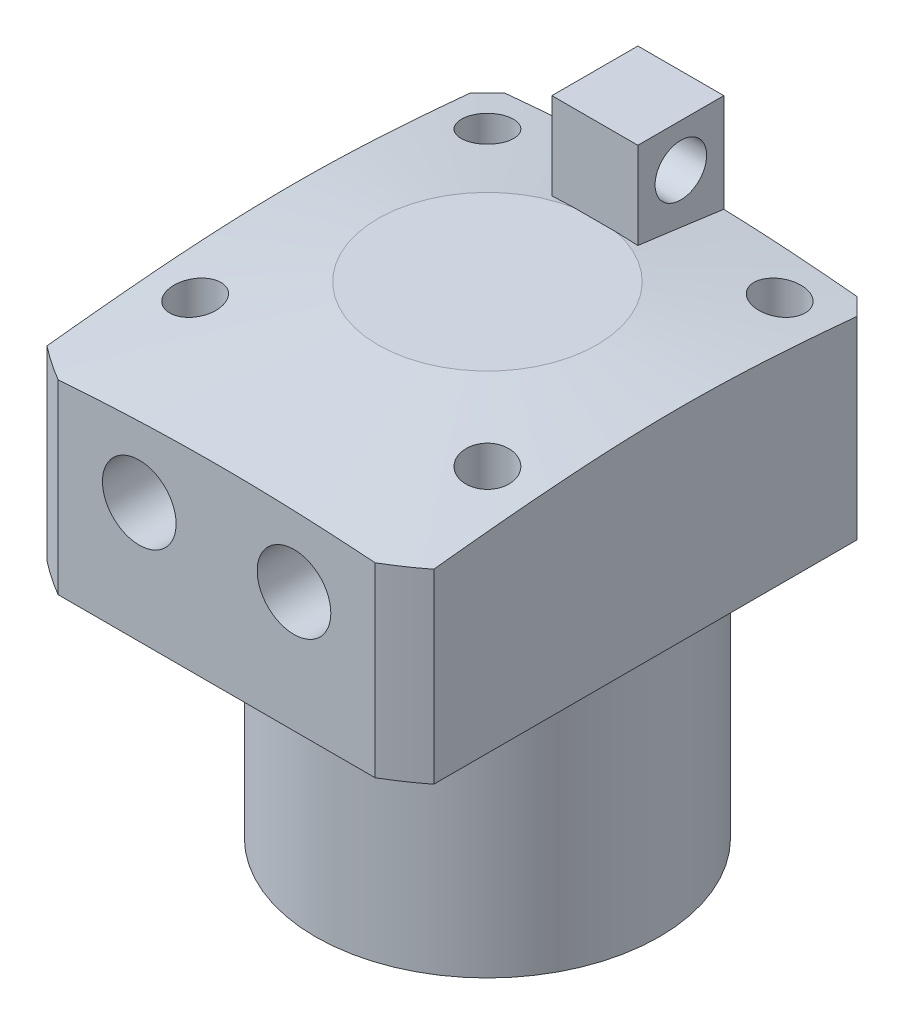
ISO-10303-21;
HEADER;
FILE_DESCRIPTION(('STEP AP214'),'2;1');
FILE_NAME('part.step','',(''),(''),'','','');
FILE_SCHEMA(('AUTOMOTIVE_DESIGN { 1 0 10303 214 1 1 1 1 }'));
ENDSEC;
DATA;
#1=APPLICATION_CONTEXT('core data for automotive mechanical design processes');
#2=APPLICATION_PROTOCOL_DEFINITION('international standard','automotive_design',2000,#1);
#3=PRODUCT_CONTEXT('',#1,'mechanical');
#4=PRODUCT('Part','Part','',(#3));
#5=PRODUCT_RELATED_PRODUCT_CATEGORY('part','',(#4));
#6=PRODUCT_DEFINITION_FORMATION('','',#4);
#7=PRODUCT_DEFINITION_CONTEXT('part definition',#1,'design');
#8=PRODUCT_DEFINITION('design','',#6,#7);
#9=PRODUCT_DEFINITION_SHAPE('','',#8);
#10=(LENGTH_UNIT() NAMED_UNIT(*) SI_UNIT(.MILLI.,.METRE.));
#11=(NAMED_UNIT(*) PLANE_ANGLE_UNIT() SI_UNIT($,.RADIAN.));
#12=(NAMED_UNIT(*) SI_UNIT($,.STERADIAN.) SOLID_ANGLE_UNIT());
#13=UNCERTAINTY_MEASURE_WITH_UNIT(LENGTH_MEASURE(1.E-05),#10,'distance_accuracy_value','');
#14=(GEOMETRIC_REPRESENTATION_CONTEXT(3) GLOBAL_UNCERTAINTY_ASSIGNED_CONTEXT((#13)) GLOBAL_UNIT_ASSIGNED_CONTEXT((#10,
#11,#12)) REPRESENTATION_CONTEXT('',''));
#15=CARTESIAN_POINT('',(0.,0.,0.));
#16=DIRECTION('',(0.,0.,1.));
#17=DIRECTION('',(1.,0.,0.));
#18=AXIS2_PLACEMENT_3D('',#15,#16,#17);
#19=CARTESIAN_POINT('',(-20.,31.,0.));
#20=DIRECTION('',(0.,-1.,0.));
#21=DIRECTION('',(0.,0.,-1.));
#22=AXIS2_PLACEMENT_3D('',#19,#20,#21);
#23=PLANE('',#22);
#24=CARTESIAN_POINT('',(-9.,31.,26.));
#25=DIRECTION('',(0.,-1.,0.));
#26=DIRECTION('',(0.,0.,-1.));
#27=AXIS2_PLACEMENT_3D('',#24,#25,#26);
#28=CIRCLE('',#27,4.);
#29=CARTESIAN_POINT('',(-9.,31.,22.));
#30=VERTEX_POINT('',#29);
#31=EDGE_CURVE('E460',#30,#30,#28,.T.);
#32=ORIENTED_EDGE('',*,*,#31,.F.);
#33=EDGE_LOOP('',(#32));
#34=FACE_BOUND('',#33,.T.);
#35=CARTESIAN_POINT('',(9.,31.,26.));
#36=DIRECTION('',(0.,-1.,0.));
#37=DIRECTION('',(0.,0.,-1.));
#38=AXIS2_PLACEMENT_3D('',#35,#36,#37);
#39=CIRCLE('',#38,4.);
#40=CARTESIAN_POINT('',(9.,31.,22.));
#41=VERTEX_POINT('',#40);
#42=EDGE_CURVE('E454',#41,#41,#39,.T.);
#43=ORIENTED_EDGE('',*,*,#42,.F.);
#44=EDGE_LOOP('',(#43));
#45=FACE_BOUND('',#44,.T.);
#46=CARTESIAN_POINT('',(-17.,31.,-17.));
#47=DIRECTION('',(0.,-1.,0.));
#48=DIRECTION('',(0.,0.,-1.));
#49=AXIS2_PLACEMENT_3D('',#46,#47,#48);
#50=CIRCLE('',#49,2.75);
#51=CARTESIAN_POINT('',(-17.,31.,-19.75));
#52=VERTEX_POINT('',#51);
#53=EDGE_CURVE('E448',#52,#52,#50,.T.);
#54=ORIENTED_EDGE('',*,*,#53,.F.);
#55=EDGE_LOOP('',(#54));
#56=FACE_BOUND('',#55,.T.);
#57=CARTESIAN_POINT('',(17.,31.,-17.));
#58=DIRECTION('',(0.,-1.,0.));
#59=DIRECTION('',(0.,0.,-1.));
#60=AXIS2_PLACEMENT_3D('',#57,#58,#59);
#61=CIRCLE('',#60,2.75);
#62=CARTESIAN_POINT('',(17.,31.,-19.75));
#63=VERTEX_POINT('',#62);
#64=EDGE_CURVE('E240',#63,#63,#61,.T.);
#65=ORIENTED_EDGE('',*,*,#64,.F.);
#66=EDGE_LOOP('',(#65));
#67=FACE_BOUND('',#66,.T.);
#68=CARTESIAN_POINT('',(17.,31.,17.));
#69=DIRECTION('',(0.,-1.,0.));
#70=DIRECTION('',(0.,0.,-1.));
#71=AXIS2_PLACEMENT_3D('',#68,#69,#70);
#72=CIRCLE('',#71,2.75);
#73=CARTESIAN_POINT('',(17.,31.,14.25));
#74=VERTEX_POINT('',#73);
#75=EDGE_CURVE('E239',#74,#74,#72,.T.);
#76=ORIENTED_EDGE('',*,*,#75,.F.);
#77=EDGE_LOOP('',(#76));
#78=FACE_BOUND('',#77,.T.);
#79=CARTESIAN_POINT('',(-17.,31.,17.));
#80=DIRECTION('',(0.,-1.,0.));
#81=DIRECTION('',(0.,0.,-1.));
#82=AXIS2_PLACEMENT_3D('',#79,#80,#81);
#83=CIRCLE('',#82,2.75);
#84=CARTESIAN_POINT('',(-17.,31.,14.25));
#85=VERTEX_POINT('',#84);
#86=EDGE_CURVE('E306',#85,#85,#83,.T.);
#87=ORIENTED_EDGE('',*,*,#86,.F.);
#88=EDGE_LOOP('',(#87));
#89=FACE_BOUND('',#88,.T.);
#90=CARTESIAN_POINT('',(0.,31.,0.));
#91=DIRECTION('',(0.,1.,0.));
#92=DIRECTION('',(0.,0.,1.));
#93=AXIS2_PLACEMENT_3D('',#90,#91,#92);
#94=CIRCLE('',#93,20.);
#95=CARTESIAN_POINT('',(0.,31.,20.));
#96=VERTEX_POINT('',#95);
#97=EDGE_CURVE('E394',#96,#96,#94,.T.);
#98=ORIENTED_EDGE('',*,*,#97,.T.);
#99=EDGE_LOOP('',(#98));
#100=FACE_BOUND('',#99,.T.);
#101=DIRECTION('',(1.,0.,0.));
#102=VECTOR('',#101,1.);
#103=CARTESIAN_POINT('',(-20.,31.,-22.5));
#104=LINE('',#103,#102);
#105=CARTESIAN_POINT('',(-20.5,31.,-22.5));
#106=VERTEX_POINT('',#105);
#107=CARTESIAN_POINT('',(20.5,31.,-22.5));
#108=VERTEX_POINT('',#107);
#109=EDGE_CURVE('E429',#106,#108,#104,.T.);
#110=ORIENTED_EDGE('',*,*,#109,.T.);
#111=DIRECTION('',(-0.70710678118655,0.,-0.707106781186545));
#112=VECTOR('',#111,1.);
#113=CARTESIAN_POINT('',(11.4999999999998,31.,-31.5000000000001));
#114=LINE('',#113,#112);
#115=CARTESIAN_POINT('',(22.5,31.,-20.5));
#116=VERTEX_POINT('',#115);
#117=EDGE_CURVE('E47',#108,#116,#114,.F.);
#118=ORIENTED_EDGE('',*,*,#117,.T.);
#119=DIRECTION('',(0.,0.,1.));
#120=VECTOR('',#119,1.);
#121=CARTESIAN_POINT('',(22.5,31.,0.));
#122=LINE('',#121,#120);
#123=CARTESIAN_POINT('',(22.5,31.,28.7402157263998));
#124=VERTEX_POINT('',#123);
#125=EDGE_CURVE('E409',#116,#124,#122,.T.);
#126=ORIENTED_EDGE('',*,*,#125,.T.);
#127=CARTESIAN_POINT('',(0.,31.,0.));
#128=DIRECTION('',(0.,1.,0.));
#129=DIRECTION('',(0.,0.,1.));
#130=AXIS2_PLACEMENT_3D('',#127,#128,#129);
#131=CIRCLE('',#130,36.5);
#132=CARTESIAN_POINT('',(18.4390889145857,31.,31.5));
#133=VERTEX_POINT('',#132);
#134=EDGE_CURVE('E397',#133,#124,#131,.T.);
#135=ORIENTED_EDGE('',*,*,#134,.F.);
#136=DIRECTION('',(-1.,0.,0.));
#137=VECTOR('',#136,1.);
#138=CARTESIAN_POINT('',(-20.,31.,31.5));
#139=LINE('',#138,#137);
#140=CARTESIAN_POINT('',(-18.4390889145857,31.,31.5));
#141=VERTEX_POINT('',#140);
#142=EDGE_CURVE('E414',#133,#141,#139,.T.);
#143=ORIENTED_EDGE('',*,*,#142,.T.);
#144=CARTESIAN_POINT('',(-22.5,31.,28.7402157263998));
#145=VERTEX_POINT('',#144);
#146=EDGE_CURVE('E402',#145,#141,#131,.T.);
#147=ORIENTED_EDGE('',*,*,#146,.F.);
#148=DIRECTION('',(0.,0.,-1.));
#149=VECTOR('',#148,1.);
#150=CARTESIAN_POINT('',(-22.5,31.,0.));
#151=LINE('',#150,#149);
#152=CARTESIAN_POINT('',(-22.5,31.,-20.5));
#153=VERTEX_POINT('',#152);
#154=EDGE_CURVE('E423',#145,#153,#151,.T.);
#155=ORIENTED_EDGE('',*,*,#154,.T.);
#156=DIRECTION('',(-0.707106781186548,0.,0.707106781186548));
#157=VECTOR('',#156,1.);
#158=CARTESIAN_POINT('',(-31.5,31.,-11.5));
#159=LINE('',#158,#157);
#160=EDGE_CURVE('E376',#153,#106,#159,.F.);
#161=ORIENTED_EDGE('',*,*,#160,.T.);
#162=EDGE_LOOP('',(#110,#118,#126,#135,#143,#147,#155,#161));
#163=FACE_BOUND('',#162,.T.);
#164=ADVANCED_FACE('F33',(#34,#45,#56,#67,#78,#89,#100,#163),#23,.T.);
#165=CARTESIAN_POINT('',(0.,87.0508296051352,0.));
#166=DIRECTION('',(0.,1.,0.));
#167=DIRECTION('',(0.,0.,1.));
#168=AXIS2_PLACEMENT_3D('',#165,#166,#167);
#169=CYLINDRICAL_SURFACE('',#168,36.5);
#170=ORIENTED_EDGE('',*,*,#134,.T.);
#171=DIRECTION('',(0.,1.,0.));
#172=VECTOR('',#171,1.);
#173=CARTESIAN_POINT('',(22.5,87.0508296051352,28.7402157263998));
#174=LINE('',#173,#172);
#175=CARTESIAN_POINT('',(22.5,52.6597127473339,28.7402157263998));
#176=VERTEX_POINT('',#175);
#177=EDGE_CURVE('E411',#124,#176,#174,.T.);
#178=ORIENTED_EDGE('',*,*,#177,.T.);
#179=CARTESIAN_POINT('',(0.,52.6597127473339,0.));
#180=DIRECTION('',(0.,1.,0.));
#181=DIRECTION('',(0.,0.,1.));
#182=AXIS2_PLACEMENT_3D('',#179,#180,#181);
#183=CIRCLE('',#182,36.5);
#184=CARTESIAN_POINT('',(18.4390889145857,52.6597127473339,31.5));
#185=VERTEX_POINT('',#184);
#186=EDGE_CURVE('E403',#185,#176,#183,.T.);
#187=ORIENTED_EDGE('',*,*,#186,.F.);
#188=DIRECTION('',(0.,1.,0.));
#189=VECTOR('',#188,1.);
#190=CARTESIAN_POINT('',(18.4390889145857,87.0508296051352,31.5));
#191=LINE('',#190,#189);
#192=EDGE_CURVE('E417',#185,#133,#191,.F.);
#193=ORIENTED_EDGE('',*,*,#192,.T.);
#194=EDGE_LOOP('',(#170,#178,#187,#193));
#195=FACE_BOUND('',#194,.T.);
#196=ADVANCED_FACE('F254',(#195),#169,.T.);
#197=ORIENTED_EDGE('',*,*,#146,.T.);
#198=DIRECTION('',(0.,1.,0.));
#199=VECTOR('',#198,1.);
#200=CARTESIAN_POINT('',(-18.4390889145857,87.0508296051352,31.5));
#201=LINE('',#200,#199);
#202=CARTESIAN_POINT('',(-18.4390889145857,52.6597127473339,31.5));
#203=VERTEX_POINT('',#202);
#204=EDGE_CURVE('E420',#141,#203,#201,.T.);
#205=ORIENTED_EDGE('',*,*,#204,.T.);
#206=CARTESIAN_POINT('',(-22.5,52.6597127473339,28.7402157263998));
#207=VERTEX_POINT('',#206);
#208=EDGE_CURVE('E405',#207,#203,#183,.T.);
#209=ORIENTED_EDGE('',*,*,#208,.F.);
#210=DIRECTION('',(0.,1.,0.));
#211=VECTOR('',#210,1.);
#212=CARTESIAN_POINT('',(-22.5,87.0508296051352,28.7402157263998));
#213=LINE('',#212,#211);
#214=EDGE_CURVE('E426',#207,#145,#213,.F.);
#215=ORIENTED_EDGE('',*,*,#214,.T.);
#216=EDGE_LOOP('',(#197,#205,#209,#215));
#217=FACE_BOUND('',#216,.T.);
#218=ADVANCED_FACE('F251',(#217),#169,.T.);
#219=CARTESIAN_POINT('',(0.,56.,0.));
#220=DIRECTION('',(0.,-1.,0.));
#221=DIRECTION('',(0.,0.,-1.));
#222=AXIS2_PLACEMENT_3D('',#219,#220,#221);
#223=CONICAL_SURFACE('',#222,12.7326212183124,1.43116998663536);
#224=CARTESIAN_POINT('',(-5.,57.0770749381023,-0.832518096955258));
#225=CARTESIAN_POINT('',(-5.,57.0721839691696,-1.04516241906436));
#226=CARTESIAN_POINT('',(-5.,57.0654284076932,-1.25775616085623));
#227=CARTESIAN_POINT('',(-5.,57.0485675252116,-1.6827958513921));
#228=CARTESIAN_POINT('',(-5.,57.0384624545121,-1.89524180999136));
#229=CARTESIAN_POINT('',(-5.,57.0036993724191,-2.53217271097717));
#230=CARTESIAN_POINT('',(-5.,56.9745891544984,-2.95641394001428));
#231=CARTESIAN_POINT('',(-5.,56.9078850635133,-3.80397223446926));
#232=CARTESIAN_POINT('',(-5.,56.8702957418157,-4.22728967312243));
#233=CARTESIAN_POINT('',(-5.,56.8095496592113,-4.86186629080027));
#234=CARTESIAN_POINT('',(-5.,56.7885725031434,-5.07333842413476));
#235=CARTESIAN_POINT('',(-5.,56.7454078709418,-5.49615936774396));
#236=CARTESIAN_POINT('',(-5.,56.7232203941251,-5.70750817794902));
#237=CARTESIAN_POINT('',(-5.,56.6660543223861,-6.23999006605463));
#238=CARTESIAN_POINT('',(-5.,56.6304246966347,-6.56105307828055));
#239=CARTESIAN_POINT('',(-5.,56.5574336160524,-7.20298268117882));
#240=CARTESIAN_POINT('',(-5.,56.5200721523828,-7.5238492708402));
#241=CARTESIAN_POINT('',(-5.,56.4060290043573,-8.48622652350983));
#242=CARTESIAN_POINT('',(-5.,56.3273896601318,-9.12750471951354));
#243=CARTESIAN_POINT('',(-5.,56.1669702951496,-10.4096658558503));
#244=CARTESIAN_POINT('',(-5.,56.0851902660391,-11.0505487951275));
#245=CARTESIAN_POINT('',(-5.,55.9195947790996,-12.3320447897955));
#246=CARTESIAN_POINT('',(-5.,55.8357793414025,-12.972657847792));
#247=CARTESIAN_POINT('',(-5.,55.6667094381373,-14.2542169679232));
#248=CARTESIAN_POINT('',(-5.,55.581453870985,-14.8951628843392));
#249=CARTESIAN_POINT('',(-5.,55.409973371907,-16.1769264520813));
#250=CARTESIAN_POINT('',(-5.,55.3237484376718,-16.8177441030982));
#251=CARTESIAN_POINT('',(-5.,55.064037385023,-18.7400308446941));
#252=CARTESIAN_POINT('',(-5.,54.8895116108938,-20.0213593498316));
#253=CARTESIAN_POINT('',(-5.,54.4813387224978,-23.0045469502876));
#254=CARTESIAN_POINT('',(-5.,54.2470977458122,-24.7063245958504));
#255=CARTESIAN_POINT('',(-5.,53.7771263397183,-28.1096862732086));
#256=CARTESIAN_POINT('',(-5.,53.5413958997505,-29.8112703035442));
#257=CARTESIAN_POINT('',(-5.,53.0693263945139,-33.2122525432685));
#258=CARTESIAN_POINT('',(-5.,52.8329884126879,-34.9116509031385));
#259=CARTESIAN_POINT('',(-5.,52.3597112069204,-38.3103504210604));
#260=CARTESIAN_POINT('',(-5.,52.1227719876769,-40.0096515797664));
#261=CARTESIAN_POINT('',(-5.,51.8856759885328,-41.7089307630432));
#262=B_SPLINE_CURVE_WITH_KNOTS('',3,(#224,#225,#226,#227,#228,#229,#230,#231,#232,#233,#234,
#235,#236,#237,#238,#239,#240,#241,#242,#243,#244,#245,#246,#247,#248,#249,#250,#251,#252,#253,
#254,#255,#256,#257,#258,#259,#260,#261),.UNSPECIFIED.,.F.,.F.,(4,2,2,2,2,2,2,2,2,2,2,2,2,2,2,2,
2,2,4),(0.,0.638081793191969,1.27611591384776,2.5516943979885,3.82658980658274,4.46411708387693,
5.10164472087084,6.07073983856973,7.03983990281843,8.97807006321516,10.9163053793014,
12.8545215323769,14.7942942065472,16.7340715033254,20.613548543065,25.7670165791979,
30.9205211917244,36.0677818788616,41.2150024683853),.UNSPECIFIED.);
#263=CARTESIAN_POINT('',(-5.,55.8973643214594,-12.5));
#264=VERTEX_POINT('',#263);
#265=CARTESIAN_POINT('',(-5.,54.5501470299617,-22.5));
#266=VERTEX_POINT('',#265);
#267=EDGE_CURVE('E173',#264,#266,#262,.T.);
#268=ORIENTED_EDGE('',*,*,#267,.T.);
#269=CARTESIAN_POINT('',(-44.9094085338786,50.7300142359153,-22.5));
#270=CARTESIAN_POINT('',(-43.7407308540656,50.8768379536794,-22.5));
#271=CARTESIAN_POINT('',(-42.5719151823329,51.0225748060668,-22.5));
#272=CARTESIAN_POINT('',(-40.233937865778,51.3112923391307,-22.5));
#273=CARTESIAN_POINT('',(-39.0647762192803,51.4542730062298,-22.5));
#274=CARTESIAN_POINT('',(-36.7260861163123,51.7368897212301,-22.5));
#275=CARTESIAN_POINT('',(-35.5565576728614,51.8765258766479,-22.5));
#276=CARTESIAN_POINT('',(-33.2170146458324,52.1516643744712,-22.5));
#277=CARTESIAN_POINT('',(-32.047000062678,52.2871667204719,-22.5));
#278=CARTESIAN_POINT('',(-29.7080341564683,52.5528341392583,-22.5));
#279=CARTESIAN_POINT('',(-28.53908365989,52.6830064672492,-22.5));
#280=CARTESIAN_POINT('',(-26.2004786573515,52.9368986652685,-22.5));
#281=CARTESIAN_POINT('',(-25.0308241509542,53.0606185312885,-22.5));
#282=CARTESIAN_POINT('',(-22.6905117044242,53.2999169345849,-22.5));
#283=CARTESIAN_POINT('',(-21.5198536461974,53.4154943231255,-22.5));
#284=CARTESIAN_POINT('',(-19.1775530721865,53.6363016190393,-22.5));
#285=CARTESIAN_POINT('',(-18.0059105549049,53.7415315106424,-22.5));
#286=CARTESIAN_POINT('',(-15.6576582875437,53.9392352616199,-22.5));
#287=CARTESIAN_POINT('',(-14.4810448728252,54.0316660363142,-22.5));
#288=CARTESIAN_POINT('',(-12.1266260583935,54.2000750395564,-22.5));
#289=CARTESIAN_POINT('',(-10.9488206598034,54.2760532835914,-22.5));
#290=CARTESIAN_POINT('',(-8.59243927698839,54.4079523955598,-22.5));
#291=CARTESIAN_POINT('',(-7.41386365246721,54.4638795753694,-22.5));
#292=CARTESIAN_POINT('',(-5.05582751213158,54.5523669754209,-22.5));
#293=CARTESIAN_POINT('',(-3.87636700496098,54.5849274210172,-22.5));
#294=CARTESIAN_POINT('',(-1.51572552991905,54.6244012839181,-22.5));
#295=CARTESIAN_POINT('',(-0.334544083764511,54.6312868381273,-22.5));
#296=CARTESIAN_POINT('',(2.02767707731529,54.618807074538,-22.5));
#297=CARTESIAN_POINT('',(3.20871679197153,54.599441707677,-22.5));
#298=CARTESIAN_POINT('',(5.57045261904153,54.5358953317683,-22.5));
#299=CARTESIAN_POINT('',(6.75114853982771,54.4917073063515,-22.5));
#300=CARTESIAN_POINT('',(8.52139709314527,54.4090052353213,-22.5));
#301=CARTESIAN_POINT('',(9.11134963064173,54.3787010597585,-22.5));
#302=CARTESIAN_POINT('',(10.2909742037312,54.3130589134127,-22.5));
#303=CARTESIAN_POINT('',(10.8806462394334,54.2777209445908,-22.5));
#304=CARTESIAN_POINT('',(13.1711920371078,54.131528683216,-22.5));
#305=CARTESIAN_POINT('',(14.8710102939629,54.0039123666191,-22.5));
#306=CARTESIAN_POINT('',(17.4189619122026,53.7915554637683,-22.5));
#307=CARTESIAN_POINT('',(18.2680095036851,53.7172784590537,-22.5));
#308=CARTESIAN_POINT('',(19.9655678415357,53.5628059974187,-22.5));
#309=CARTESIAN_POINT('',(20.8140785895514,53.4826105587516,-22.5));
#310=CARTESIAN_POINT('',(22.5107648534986,53.3172260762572,-22.5));
#311=CARTESIAN_POINT('',(23.3589402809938,53.2320361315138,-22.5));
#312=CARTESIAN_POINT('',(25.0548595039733,53.0574549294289,-22.5));
#313=CARTESIAN_POINT('',(25.902603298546,52.9680636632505,-22.5));
#314=CARTESIAN_POINT('',(28.4452245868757,52.6946096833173,-22.5));
#315=CARTESIAN_POINT('',(30.1395335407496,52.5052626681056,-22.5));
#316=CARTESIAN_POINT('',(33.5281388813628,52.1163493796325,-22.5));
#317=CARTESIAN_POINT('',(35.2224344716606,51.9167762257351,-22.5));
#318=CARTESIAN_POINT('',(38.6101410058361,51.5102238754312,-22.5));
#319=CARTESIAN_POINT('',(40.3035519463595,51.3032446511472,-22.5));
#320=CARTESIAN_POINT('',(43.6895034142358,50.8837842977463,-22.5));
#321=CARTESIAN_POINT('',(45.3820440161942,50.6713037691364,-22.5));
#322=CARTESIAN_POINT('',(48.7665888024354,50.2421378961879,-22.5));
#323=CARTESIAN_POINT('',(50.4585929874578,50.0254525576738,-22.5));
#324=CARTESIAN_POINT('',(53.8390618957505,49.5892270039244,-22.5));
#325=CARTESIAN_POINT('',(55.5275273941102,49.3696927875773,-22.5));
#326=CARTESIAN_POINT('',(58.9041232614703,48.9280605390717,-22.5));
#327=CARTESIAN_POINT('',(60.5922536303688,48.7059625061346,-22.5));
#328=CARTESIAN_POINT('',(65.6563540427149,48.0366059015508,-22.5));
#329=CARTESIAN_POINT('',(69.0319210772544,47.5862993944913,-22.5));
#330=CARTESIAN_POINT('',(75.7774668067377,46.6809627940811,-22.5));
#331=CARTESIAN_POINT('',(79.1474465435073,46.2259404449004,-22.5));
#332=CARTESIAN_POINT('',(84.20197075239,45.5405900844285,-22.5));
#333=CARTESIAN_POINT('',(85.8867069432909,45.3116747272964,-22.5));
#334=CARTESIAN_POINT('',(89.2560691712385,44.8530370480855,-22.5));
#335=CARTESIAN_POINT('',(90.9406952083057,44.6233147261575,-22.5));
#336=CARTESIAN_POINT('',(92.6252753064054,44.3932562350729,-22.5));
#337=B_SPLINE_CURVE_WITH_KNOTS('',3,(#269,#270,#271,#272,#273,#274,#275,#276,#277,#278,#279,
#280,#281,#282,#283,#284,#285,#286,#287,#288,#289,#290,#291,#292,#293,#294,#295,#296,#297,#298,
#299,#300,#301,#302,#303,#304,#305,#306,#307,#308,#309,#310,#311,#312,#313,#314,#315,#316,#317,
#318,#319,#320,#321,#322,#323,#324,#325,#326,#327,#328,#329,#330,#331,#332,#333,#334,#335,#336),
.UNSPECIFIED.,.F.,.F.,(4,2,2,2,2,2,2,2,2,2,2,2,2,2,2,2,2,2,2,2,2,2,2,2,2,2,2,2,2,2,2,2,2,4),(0.,
3.53359506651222,7.06720753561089,10.6007062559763,14.1342019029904,17.6627160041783,
21.1912322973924,24.7202453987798,28.2492638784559,31.7898871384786,35.3305070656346,
38.8700114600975,42.4094817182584,45.9527919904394,49.4961088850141,53.0404278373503,
54.8126007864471,56.5847730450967,61.6981805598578,64.255043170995,66.8118978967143,
69.3692152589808,71.9265380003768,77.0410582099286,82.1590660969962,87.2770932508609,
92.3945640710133,97.5120278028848,102.620058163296,107.728090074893,117.944493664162,
128.146171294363,133.246822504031,138.347472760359),.UNSPECIFIED.);
#338=CARTESIAN_POINT('',(-20.5,53.5116062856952,-22.5));
#339=VERTEX_POINT('',#338);
#340=EDGE_CURVE('E391',#266,#339,#337,.F.);
#341=ORIENTED_EDGE('',*,*,#340,.T.);
#342=CARTESIAN_POINT('',(-20.5,53.5116062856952,-22.5));
#343=CARTESIAN_POINT('',(-20.8333333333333,53.5146860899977,-22.1666666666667));
#344=CARTESIAN_POINT('',(-21.1666666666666,53.5162259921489,-21.8333333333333));
#345=CARTESIAN_POINT('',(-21.8333333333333,53.5162259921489,-21.1666666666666));
#346=CARTESIAN_POINT('',(-22.1666666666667,53.5146860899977,-20.8333333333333));
#347=CARTESIAN_POINT('',(-22.5,53.5116062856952,-20.5));
#348=B_SPLINE_CURVE_WITH_KNOTS('',3,(#342,#343,#344,#345,#346,#347),.UNSPECIFIED.,.F.,.F.,(4,2,
4),(0.,1.41422110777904,2.82844221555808),.UNSPECIFIED.);
#349=CARTESIAN_POINT('',(-22.5,53.5116062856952,-20.5));
#350=VERTEX_POINT('',#349);
#351=EDGE_CURVE('E289',#339,#350,#348,.T.);
#352=ORIENTED_EDGE('',*,*,#351,.T.);
#353=CARTESIAN_POINT('',(-22.5,50.2738884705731,-48.5122140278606));
#354=CARTESIAN_POINT('',(-22.5,50.4301800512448,-47.2861798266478));
#355=CARTESIAN_POINT('',(-22.5,50.5854813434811,-46.0600182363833));
#356=CARTESIAN_POINT('',(-22.5,50.8935707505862,-43.6073748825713));
#357=CARTESIAN_POINT('',(-22.5,51.0463588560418,-42.380893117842));
#358=CARTESIAN_POINT('',(-22.5,51.3488731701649,-39.9276743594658));
#359=CARTESIAN_POINT('',(-22.5,51.4985996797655,-38.7009374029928));
#360=CARTESIAN_POINT('',(-22.5,51.7942766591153,-36.2470084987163));
#361=CARTESIAN_POINT('',(-22.5,51.9402271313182,-35.019816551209));
#362=CARTESIAN_POINT('',(-22.5,52.2272291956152,-32.5664387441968));
#363=CARTESIAN_POINT('',(-22.5,52.3682867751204,-31.3402535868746));
#364=CARTESIAN_POINT('',(-22.5,52.6444650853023,-28.8872119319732));
#365=CARTESIAN_POINT('',(-22.5,52.7795858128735,-27.660355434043));
#366=CARTESIAN_POINT('',(-22.5,53.0422938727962,-25.2056087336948));
#367=CARTESIAN_POINT('',(-22.5,53.169879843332,-23.9777183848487));
#368=CARTESIAN_POINT('',(-22.5,53.4153685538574,-21.5209619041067));
#369=CARTESIAN_POINT('',(-22.5,53.5332712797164,-20.2920957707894));
#370=CARTESIAN_POINT('',(-22.5,53.7570192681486,-17.8292290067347));
#371=CARTESIAN_POINT('',(-22.5,53.8628240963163,-16.5952246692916));
#372=CARTESIAN_POINT('',(-22.5,54.0584900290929,-14.125934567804));
#373=CARTESIAN_POINT('',(-22.5,54.1483511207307,-12.8906488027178));
#374=CARTESIAN_POINT('',(-22.5,54.3081017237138,-10.4192193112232));
#375=CARTESIAN_POINT('',(-22.5,54.3779984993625,-9.18307606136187));
#376=CARTESIAN_POINT('',(-22.5,54.4937397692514,-6.70963880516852));
#377=CARTESIAN_POINT('',(-22.5,54.5395844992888,-5.47234481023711));
#378=CARTESIAN_POINT('',(-22.5,54.5878751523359,-3.61515323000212));
#379=CARTESIAN_POINT('',(-22.5,54.6005607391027,-2.99551159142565));
#380=CARTESIAN_POINT('',(-22.5,54.6188487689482,-1.75612506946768));
#381=CARTESIAN_POINT('',(-22.5,54.6244512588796,-1.13638018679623));
#382=CARTESIAN_POINT('',(-22.5,54.6284506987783,0.103132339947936));
#383=CARTESIAN_POINT('',(-22.5,54.6268476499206,0.72289998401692));
#384=CARTESIAN_POINT('',(-22.5,54.6164712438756,1.96237502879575));
#385=CARTESIAN_POINT('',(-22.5,54.6076978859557,2.58208242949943));
#386=CARTESIAN_POINT('',(-22.5,54.5831576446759,3.82154749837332));
#387=CARTESIAN_POINT('',(-22.5,54.5673886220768,4.4413051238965));
#388=CARTESIAN_POINT('',(-22.5,54.5291668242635,5.68061443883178));
#389=CARTESIAN_POINT('',(-22.5,54.5067140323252,6.30016612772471));
#390=CARTESIAN_POINT('',(-22.5,54.4555355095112,7.53900437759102));
#391=CARTESIAN_POINT('',(-22.5,54.4268098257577,8.15829094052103));
#392=CARTESIAN_POINT('',(-22.5,54.3635626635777,9.39656408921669));
#393=CARTESIAN_POINT('',(-22.5,54.3290412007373,10.0155506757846));
#394=CARTESIAN_POINT('',(-22.5,54.2307122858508,11.6528755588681));
#395=CARTESIAN_POINT('',(-22.5,54.1623900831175,12.6709437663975));
#396=CARTESIAN_POINT('',(-22.5,54.0137245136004,14.7062041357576));
#397=CARTESIAN_POINT('',(-22.5,53.9333809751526,15.7233962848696));
#398=CARTESIAN_POINT('',(-22.5,53.7627775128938,17.7570227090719));
#399=CARTESIAN_POINT('',(-22.5,53.6725168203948,18.7734569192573));
#400=CARTESIAN_POINT('',(-22.5,53.4839016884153,20.8055638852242));
#401=CARTESIAN_POINT('',(-22.5,53.3855472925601,21.8212366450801));
#402=CARTESIAN_POINT('',(-22.5,53.1822215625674,23.8522072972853));
#403=CARTESIAN_POINT('',(-22.5,53.0772483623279,24.8675050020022));
#404=CARTESIAN_POINT('',(-22.5,52.8619307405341,26.8975297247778));
#405=CARTESIAN_POINT('',(-22.5,52.7515863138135,27.9122567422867));
#406=CARTESIAN_POINT('',(-22.5,52.5265105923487,29.9411824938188));
#407=CARTESIAN_POINT('',(-22.5,52.411779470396,30.9553812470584));
#408=CARTESIAN_POINT('',(-22.5,52.178700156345,32.9833635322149));
#409=CARTESIAN_POINT('',(-22.5,52.0603519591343,33.9971470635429));
#410=CARTESIAN_POINT('',(-22.5,51.7006051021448,37.0400316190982));
#411=CARTESIAN_POINT('',(-22.5,51.4547357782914,39.0686038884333));
#412=CARTESIAN_POINT('',(-22.5,50.9547033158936,43.1247348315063));
#413=CARTESIAN_POINT('',(-22.5,50.7005401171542,45.1522934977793));
#414=CARTESIAN_POINT('',(-22.5,50.1862714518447,49.2063104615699));
#415=CARTESIAN_POINT('',(-22.5,49.9261669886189,51.2327688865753));
#416=CARTESIAN_POINT('',(-22.5,49.4015401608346,55.2851078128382));
#417=CARTESIAN_POINT('',(-22.5,49.1370178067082,57.3109883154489));
#418=CARTESIAN_POINT('',(-22.5,48.6050491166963,61.3591295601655));
#419=CARTESIAN_POINT('',(-22.5,48.3376080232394,63.3813909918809));
#420=CARTESIAN_POINT('',(-22.5,47.8001462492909,67.4255718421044));
#421=CARTESIAN_POINT('',(-22.5,47.530125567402,69.4474912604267));
#422=CARTESIAN_POINT('',(-22.5,46.7170238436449,75.5130600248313));
#423=CARTESIAN_POINT('',(-22.5,46.1709314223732,79.5563055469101));
#424=CARTESIAN_POINT('',(-22.5,45.0746281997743,87.6343715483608));
#425=CARTESIAN_POINT('',(-22.5,44.52442725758,91.6691933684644));
#426=CARTESIAN_POINT('',(-22.5,43.6964778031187,97.7209487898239));
#427=CARTESIAN_POINT('',(-22.5,43.4200610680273,99.7380647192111));
#428=CARTESIAN_POINT('',(-22.5,42.8664721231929,103.772192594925));
#429=CARTESIAN_POINT('',(-22.5,42.5892999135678,105.789204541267));
#430=CARTESIAN_POINT('',(-22.5,42.3118160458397,107.806173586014));
#431=B_SPLINE_CURVE_WITH_KNOTS('',3,(#353,#354,#355,#356,#357,#358,#359,#360,#361,#362,#363,
#364,#365,#366,#367,#368,#369,#370,#371,#372,#373,#374,#375,#376,#377,#378,#379,#380,#381,#382,
#383,#384,#385,#386,#387,#388,#389,#390,#391,#392,#393,#394,#395,#396,#397,#398,#399,#400,#401,
#402,#403,#404,#405,#406,#407,#408,#409,#410,#411,#412,#413,#414,#415,#416,#417,#418,#419,#420,
#421,#422,#423,#424,#425,#426,#427,#428,#429,#430),.UNSPECIFIED.,.F.,.F.,(4,2,2,2,2,2,2,2,2,2,2,
2,2,2,2,2,2,2,2,2,2,2,2,2,2,2,2,2,2,2,2,2,2,2,2,2,2,2,4),(0.,3.70786892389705,7.41575173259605,
11.1232683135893,14.8307824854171,18.5335871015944,22.2363936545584,25.9398674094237,
29.6433465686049,33.3588626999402,37.0743818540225,40.7885473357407,44.5026764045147,
46.3619565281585,48.2212243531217,50.0804918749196,51.9397595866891,53.7995962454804,
55.6594375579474,57.519264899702,59.3790872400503,62.4400680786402,65.5010926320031,
68.5623546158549,71.6236001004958,74.6857125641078,77.747827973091,80.8098228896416,
83.8718221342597,90.0020475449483,96.1323174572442,102.261559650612,108.390787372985,
114.510392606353,120.630001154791,132.869866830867,145.086352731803,151.194254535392,
157.30215538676),.UNSPECIFIED.);
#432=EDGE_CURVE('E268',#350,#207,#431,.T.);
#433=ORIENTED_EDGE('',*,*,#432,.T.);
#434=ORIENTED_EDGE('',*,*,#208,.T.);
#435=CARTESIAN_POINT('',(-52.4742344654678,49.1879462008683,31.5));
#436=CARTESIAN_POINT('',(-50.9884814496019,49.3669352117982,31.5));
#437=CARTESIAN_POINT('',(-49.5024949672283,49.5440150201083,31.5));
#438=CARTESIAN_POINT('',(-46.5299410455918,49.8933444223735,31.5));
#439=CARTESIAN_POINT('',(-45.0433736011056,50.0655939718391,31.5));
#440=CARTESIAN_POINT('',(-42.0693310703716,50.4042750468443,31.5));
#441=CARTESIAN_POINT('',(-40.5818558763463,50.5707056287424,31.5));
#442=CARTESIAN_POINT('',(-37.6061172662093,50.8963618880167,31.5));
#443=CARTESIAN_POINT('',(-36.1178538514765,51.0555875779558,31.5));
#444=CARTESIAN_POINT('',(-33.1432611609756,51.364836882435,31.5));
#445=CARTESIAN_POINT('',(-31.6569336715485,51.5148776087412,31.5));
#446=CARTESIAN_POINT('',(-28.6832021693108,51.803959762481,31.5));
#447=CARTESIAN_POINT('',(-27.1957981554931,51.9430011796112,31.5));
#448=CARTESIAN_POINT('',(-24.2197321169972,52.207457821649,31.5));
#449=CARTESIAN_POINT('',(-22.731070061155,52.3328726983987,31.5));
#450=CARTESIAN_POINT('',(-19.7524136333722,52.566921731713,31.5));
#451=CARTESIAN_POINT('',(-18.2624192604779,52.6755558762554,31.5));
#452=CARTESIAN_POINT('',(-15.2763504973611,52.872781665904,31.5));
#453=CARTESIAN_POINT('',(-13.7802717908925,52.9613087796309,31.5));
#454=CARTESIAN_POINT('',(-10.7868824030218,53.1141425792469,31.5));
#455=CARTESIAN_POINT('',(-9.28957174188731,53.1784496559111,31.5));
#456=CARTESIAN_POINT('',(-6.29427428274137,53.2795230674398,31.5));
#457=CARTESIAN_POINT('',(-4.79628765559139,53.3162943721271,31.5));
#458=CARTESIAN_POINT('',(-1.79987641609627,53.3601412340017,31.5));
#459=CARTESIAN_POINT('',(-0.301451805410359,53.367216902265,31.5));
#460=CARTESIAN_POINT('',(2.69679866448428,53.3512194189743,31.5));
#461=CARTESIAN_POINT('',(4.1966243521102,53.3281147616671,31.5));
#462=CARTESIAN_POINT('',(7.19555003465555,53.2531245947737,31.5));
#463=CARTESIAN_POINT('',(8.69465002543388,53.2012389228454,31.5));
#464=CARTESIAN_POINT('',(11.6920227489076,53.0715542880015,31.5));
#465=CARTESIAN_POINT('',(13.1902952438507,52.9937499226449,31.5));
#466=CARTESIAN_POINT('',(16.1854982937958,52.8158626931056,31.5));
#467=CARTESIAN_POINT('',(17.6824288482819,52.7157798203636,31.5));
#468=CARTESIAN_POINT('',(20.8787257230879,52.482179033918,31.5));
#469=CARTESIAN_POINT('',(22.5778930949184,52.3459637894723,31.5));
#470=CARTESIAN_POINT('',(25.9746114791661,52.0545595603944,31.5));
#471=CARTESIAN_POINT('',(27.6721624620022,51.8993702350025,31.5));
#472=CARTESIAN_POINT('',(31.0659416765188,51.5741112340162,31.5));
#473=CARTESIAN_POINT('',(32.7621698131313,51.4040405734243,31.5));
#474=CARTESIAN_POINT('',(36.1534023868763,51.0522676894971,31.5));
#475=CARTESIAN_POINT('',(37.8484068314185,50.870565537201,31.5));
#476=CARTESIAN_POINT('',(41.2378139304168,50.4979803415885,31.5));
#477=CARTESIAN_POINT('',(42.9322163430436,50.3070951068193,31.5));
#478=CARTESIAN_POINT('',(46.3201901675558,49.9180920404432,31.5));
#479=CARTESIAN_POINT('',(48.0137615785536,49.7199742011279,31.5));
#480=CARTESIAN_POINT('',(51.4001507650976,49.3179709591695,31.5));
#481=CARTESIAN_POINT('',(53.0929685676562,49.1140857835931,31.5));
#482=CARTESIAN_POINT('',(56.4780348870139,48.7016573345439,31.5));
#483=CARTESIAN_POINT('',(58.1702834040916,48.493114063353,31.5));
#484=CARTESIAN_POINT('',(61.5495661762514,48.0728236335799,31.5));
#485=CARTESIAN_POINT('',(63.2366017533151,47.861087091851,31.5));
#486=CARTESIAN_POINT('',(66.610279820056,47.4345033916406,31.5));
#487=CARTESIAN_POINT('',(68.2969223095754,47.2196562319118,31.5));
#488=CARTESIAN_POINT('',(73.3563935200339,46.5712626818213,31.5));
#489=CARTESIAN_POINT('',(76.7287292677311,46.1338688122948,31.5));
#490=CARTESIAN_POINT('',(81.785342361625,45.47249585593,31.5));
#491=CARTESIAN_POINT('',(83.4699768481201,45.2512360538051,31.5));
#492=CARTESIAN_POINT('',(86.8390405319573,44.807156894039,31.5));
#493=CARTESIAN_POINT('',(88.5234697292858,44.5843375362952,31.5));
#494=CARTESIAN_POINT('',(91.8921247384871,44.1373710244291,31.5));
#495=CARTESIAN_POINT('',(93.5763505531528,43.9132238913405,31.5));
#496=CARTESIAN_POINT('',(96.9446473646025,43.4637728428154,31.5));
#497=CARTESIAN_POINT('',(98.62871836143,43.2384689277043,31.5));
#498=CARTESIAN_POINT('',(100.312723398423,43.0126738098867,31.5));
#499=B_SPLINE_CURVE_WITH_KNOTS('',3,(#435,#436,#437,#438,#439,#440,#441,#442,#443,#444,#445,
#446,#447,#448,#449,#450,#451,#452,#453,#454,#455,#456,#457,#458,#459,#460,#461,#462,#463,#464,
#465,#466,#467,#468,#469,#470,#471,#472,#473,#474,#475,#476,#477,#478,#479,#480,#481,#482,#483,
#484,#485,#486,#487,#488,#489,#490,#491,#492,#493,#494,#495,#496,#497,#498),.UNSPECIFIED.,.F.,
.F.,(4,2,2,2,2,2,2,2,2,2,2,2,2,2,2,2,2,2,2,2,2,2,2,2,2,2,2,2,2,2,2,4),(0.,4.48949072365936,
8.97902278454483,13.4692795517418,17.9595284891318,22.441140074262,26.9227558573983,
31.4044861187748,35.8862195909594,40.3821396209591,44.877987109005,49.3730229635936,
53.8680420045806,58.3677572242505,62.8674978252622,67.3681769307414,71.8688577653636,
76.9825747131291,82.0963835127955,87.2105310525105,92.3246473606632,97.4399902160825,
102.555338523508,107.670485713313,112.785630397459,117.886439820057,122.987251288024,
133.188985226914,138.286292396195,143.383599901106,148.480826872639,153.578052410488),.UNSPECIFIED.);
#500=EDGE_CURVE('E281',#203,#185,#499,.T.);
#501=ORIENTED_EDGE('',*,*,#500,.T.);
#502=ORIENTED_EDGE('',*,*,#186,.T.);
#503=CARTESIAN_POINT('',(22.5,50.2738884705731,-48.5122140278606));
#504=CARTESIAN_POINT('',(22.5,50.4301800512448,-47.2861798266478));
#505=CARTESIAN_POINT('',(22.5,50.5854813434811,-46.0600182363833));
#506=CARTESIAN_POINT('',(22.5,50.8935707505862,-43.6073748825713));
#507=CARTESIAN_POINT('',(22.5,51.0463588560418,-42.380893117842));
#508=CARTESIAN_POINT('',(22.5,51.3488731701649,-39.9276743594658));
#509=CARTESIAN_POINT('',(22.5,51.4985996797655,-38.7009374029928));
#510=CARTESIAN_POINT('',(22.5,51.7942766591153,-36.2470084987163));
#511=CARTESIAN_POINT('',(22.5,51.9402271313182,-35.019816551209));
#512=CARTESIAN_POINT('',(22.5,52.2272291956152,-32.5664387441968));
#513=CARTESIAN_POINT('',(22.5,52.3682867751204,-31.3402535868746));
#514=CARTESIAN_POINT('',(22.5,52.6444650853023,-28.8872119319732));
#515=CARTESIAN_POINT('',(22.5,52.7795858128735,-27.660355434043));
#516=CARTESIAN_POINT('',(22.5,53.0422938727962,-25.2056087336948));
#517=CARTESIAN_POINT('',(22.5,53.169879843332,-23.9777183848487));
#518=CARTESIAN_POINT('',(22.5,53.4153685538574,-21.5209619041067));
#519=CARTESIAN_POINT('',(22.5,53.5332712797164,-20.2920957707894));
#520=CARTESIAN_POINT('',(22.5,53.7570192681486,-17.8292290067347));
#521=CARTESIAN_POINT('',(22.5,53.8628240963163,-16.5952246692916));
#522=CARTESIAN_POINT('',(22.5,54.0584900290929,-14.125934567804));
#523=CARTESIAN_POINT('',(22.5,54.1483511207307,-12.8906488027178));
#524=CARTESIAN_POINT('',(22.5,54.3081017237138,-10.4192193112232));
#525=CARTESIAN_POINT('',(22.5,54.3779984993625,-9.18307606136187));
#526=CARTESIAN_POINT('',(22.5,54.4937397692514,-6.70963880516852));
#527=CARTESIAN_POINT('',(22.5,54.5395844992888,-5.47234481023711));
#528=CARTESIAN_POINT('',(22.5,54.5878751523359,-3.61515323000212));
#529=CARTESIAN_POINT('',(22.5,54.6005607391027,-2.99551159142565));
#530=CARTESIAN_POINT('',(22.5,54.6188487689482,-1.75612506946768));
#531=CARTESIAN_POINT('',(22.5,54.6244512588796,-1.13638018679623));
#532=CARTESIAN_POINT('',(22.5,54.6284506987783,0.103132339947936));
#533=CARTESIAN_POINT('',(22.5,54.6268476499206,0.72289998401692));
#534=CARTESIAN_POINT('',(22.5,54.6164712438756,1.96237502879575));
#535=CARTESIAN_POINT('',(22.5,54.6076978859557,2.58208242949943));
#536=CARTESIAN_POINT('',(22.5,54.5831576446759,3.82154749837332));
#537=CARTESIAN_POINT('',(22.5,54.5673886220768,4.4413051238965));
#538=CARTESIAN_POINT('',(22.5,54.5291668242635,5.68061443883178));
#539=CARTESIAN_POINT('',(22.5,54.5067140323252,6.30016612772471));
#540=CARTESIAN_POINT('',(22.5,54.4555355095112,7.53900437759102));
#541=CARTESIAN_POINT('',(22.5,54.4268098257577,8.15829094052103));
#542=CARTESIAN_POINT('',(22.5,54.3635626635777,9.39656408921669));
#543=CARTESIAN_POINT('',(22.5,54.3290412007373,10.0155506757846));
#544=CARTESIAN_POINT('',(22.5,54.2307122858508,11.6528755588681));
#545=CARTESIAN_POINT('',(22.5,54.1623900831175,12.6709437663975));
#546=CARTESIAN_POINT('',(22.5,54.0137245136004,14.7062041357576));
#547=CARTESIAN_POINT('',(22.5,53.9333809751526,15.7233962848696));
#548=CARTESIAN_POINT('',(22.5,53.7627775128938,17.7570227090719));
#549=CARTESIAN_POINT('',(22.5,53.6725168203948,18.7734569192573));
#550=CARTESIAN_POINT('',(22.5,53.4839016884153,20.8055638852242));
#551=CARTESIAN_POINT('',(22.5,53.3855472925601,21.8212366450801));
#552=CARTESIAN_POINT('',(22.5,53.1822215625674,23.8522072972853));
#553=CARTESIAN_POINT('',(22.5,53.0772483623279,24.8675050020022));
#554=CARTESIAN_POINT('',(22.5,52.8619307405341,26.8975297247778));
#555=CARTESIAN_POINT('',(22.5,52.7515863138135,27.9122567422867));
#556=CARTESIAN_POINT('',(22.5,52.5265105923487,29.9411824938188));
#557=CARTESIAN_POINT('',(22.5,52.411779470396,30.9553812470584));
#558=CARTESIAN_POINT('',(22.5,52.178700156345,32.9833635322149));
#559=CARTESIAN_POINT('',(22.5,52.0603519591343,33.9971470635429));
#560=CARTESIAN_POINT('',(22.5,51.7006051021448,37.0400316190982));
#561=CARTESIAN_POINT('',(22.5,51.4547357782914,39.0686038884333));
#562=CARTESIAN_POINT('',(22.5,50.9547033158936,43.1247348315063));
#563=CARTESIAN_POINT('',(22.5,50.7005401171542,45.1522934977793));
#564=CARTESIAN_POINT('',(22.5,50.1862714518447,49.2063104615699));
#565=CARTESIAN_POINT('',(22.5,49.9261669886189,51.2327688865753));
#566=CARTESIAN_POINT('',(22.5,49.4015401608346,55.2851078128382));
#567=CARTESIAN_POINT('',(22.5,49.1370178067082,57.3109883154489));
#568=CARTESIAN_POINT('',(22.5,48.6050491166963,61.3591295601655));
#569=CARTESIAN_POINT('',(22.5,48.3376080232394,63.3813909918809));
#570=CARTESIAN_POINT('',(22.5,47.8001462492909,67.4255718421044));
#571=CARTESIAN_POINT('',(22.5,47.530125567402,69.4474912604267));
#572=CARTESIAN_POINT('',(22.5,46.7170238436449,75.5130600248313));
#573=CARTESIAN_POINT('',(22.5,46.1709314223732,79.5563055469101));
#574=CARTESIAN_POINT('',(22.5,45.0746281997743,87.6343715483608));
#575=CARTESIAN_POINT('',(22.5,44.52442725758,91.6691933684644));
#576=CARTESIAN_POINT('',(22.5,43.6964778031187,97.7209487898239));
#577=CARTESIAN_POINT('',(22.5,43.4200610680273,99.7380647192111));
#578=CARTESIAN_POINT('',(22.5,42.8664721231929,103.772192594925));
#579=CARTESIAN_POINT('',(22.5,42.5892999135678,105.789204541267));
#580=CARTESIAN_POINT('',(22.5,42.3118160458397,107.806173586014));
#581=B_SPLINE_CURVE_WITH_KNOTS('',3,(#503,#504,#505,#506,#507,#508,#509,#510,#511,#512,#513,
#514,#515,#516,#517,#518,#519,#520,#521,#522,#523,#524,#525,#526,#527,#528,#529,#530,#531,#532,
#533,#534,#535,#536,#537,#538,#539,#540,#541,#542,#543,#544,#545,#546,#547,#548,#549,#550,#551,
#552,#553,#554,#555,#556,#557,#558,#559,#560,#561,#562,#563,#564,#565,#566,#567,#568,#569,#570,
#571,#572,#573,#574,#575,#576,#577,#578,#579,#580),.UNSPECIFIED.,.F.,.F.,(4,2,2,2,2,2,2,2,2,2,2,
2,2,2,2,2,2,2,2,2,2,2,2,2,2,2,2,2,2,2,2,2,2,2,2,2,2,2,4),(0.,3.70786892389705,7.41575173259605,
11.1232683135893,14.8307824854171,18.5335871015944,22.2363936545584,25.9398674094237,
29.6433465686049,33.3588626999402,37.0743818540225,40.7885473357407,44.5026764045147,
46.3619565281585,48.2212243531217,50.0804918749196,51.9397595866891,53.7995962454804,
55.6594375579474,57.519264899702,59.3790872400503,62.4400680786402,65.5010926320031,
68.5623546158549,71.6236001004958,74.6857125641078,77.747827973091,80.8098228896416,
83.8718221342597,90.0020475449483,96.1323174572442,102.261559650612,108.390787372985,
114.510392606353,120.630001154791,132.869866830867,145.086352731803,151.194254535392,
157.30215538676),.UNSPECIFIED.);
#582=CARTESIAN_POINT('',(22.5,53.5116062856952,-20.5));
#583=VERTEX_POINT('',#582);
#584=EDGE_CURVE('E275',#176,#583,#581,.F.);
#585=ORIENTED_EDGE('',*,*,#584,.T.);
#586=CARTESIAN_POINT('',(22.5,53.5116062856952,-20.5));
#587=CARTESIAN_POINT('',(22.1666666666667,53.5146860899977,-20.8333333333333));
#588=CARTESIAN_POINT('',(21.8333333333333,53.5162259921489,-21.1666666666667));
#589=CARTESIAN_POINT('',(21.1666666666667,53.5162259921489,-21.8333333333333));
#590=CARTESIAN_POINT('',(20.8333333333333,53.5146860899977,-22.1666666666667));
#591=CARTESIAN_POINT('',(20.5,53.5116062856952,-22.5));
#592=B_SPLINE_CURVE_WITH_KNOTS('',3,(#586,#587,#588,#589,#590,#591),.UNSPECIFIED.,.F.,.F.,(4,2,
4),(0.,1.41422110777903,2.82844221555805),.UNSPECIFIED.);
#593=CARTESIAN_POINT('',(20.5,53.5116062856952,-22.5));
#594=VERTEX_POINT('',#593);
#595=EDGE_CURVE('E295',#583,#594,#592,.T.);
#596=ORIENTED_EDGE('',*,*,#595,.T.);
#597=CARTESIAN_POINT('',(5.00000000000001,54.5501470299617,-22.5));
#598=VERTEX_POINT('',#597);
#599=EDGE_CURVE('E259',#594,#598,#337,.F.);
#600=ORIENTED_EDGE('',*,*,#599,.T.);
#601=CARTESIAN_POINT('',(5.,51.8856759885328,-41.7089307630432));
#602=CARTESIAN_POINT('',(5.,52.1229366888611,-40.0084608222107));
#603=CARTESIAN_POINT('',(5.,52.3600425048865,-38.3079691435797));
#604=CARTESIAN_POINT('',(5.,52.833638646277,-34.9069833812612));
#605=CARTESIAN_POINT('',(5.,53.0701290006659,-33.2064893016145));
#606=CARTESIAN_POINT('',(5.,53.424175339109,-30.6557657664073));
#607=CARTESIAN_POINT('',(5.,53.542068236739,-29.8055830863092));
#608=CARTESIAN_POINT('',(5.,53.7775602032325,-28.1051780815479));
#609=CARTESIAN_POINT('',(5.,53.8951592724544,-27.2549557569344));
#610=CARTESIAN_POINT('',(5.,54.1299810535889,-25.5544198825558));
#611=CARTESIAN_POINT('',(5.,54.2472037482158,-24.7041063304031));
#612=CARTESIAN_POINT('',(5.,54.4811382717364,-23.0034050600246));
#613=CARTESIAN_POINT('',(5.,54.597850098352,-22.1530173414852));
#614=CARTESIAN_POINT('',(5.,54.8306001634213,-20.451911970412));
#615=CARTESIAN_POINT('',(5.,54.9466382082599,-19.6011942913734));
#616=CARTESIAN_POINT('',(5.,55.1777043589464,-17.8996355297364));
#617=CARTESIAN_POINT('',(5.,55.2927324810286,-17.0487944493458));
#618=CARTESIAN_POINT('',(5.,55.5212605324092,-15.3470293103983));
#619=CARTESIAN_POINT('',(5.,55.6347606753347,-14.4961052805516));
#620=CARTESIAN_POINT('',(5.,55.8593994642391,-12.7938929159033));
#621=CARTESIAN_POINT('',(5.,55.9705379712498,-11.9426045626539));
#622=CARTESIAN_POINT('',(5.,56.1342089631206,-10.6650667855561));
#623=CARTESIAN_POINT('',(5.,56.1882729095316,-10.2390138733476));
#624=CARTESIAN_POINT('',(5.,56.2950001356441,-9.38673584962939));
#625=CARTESIAN_POINT('',(5.,56.3476634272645,-8.96051073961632));
#626=CARTESIAN_POINT('',(5.,56.4510528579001,-8.1079021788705));
#627=CARTESIAN_POINT('',(5.,56.5017793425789,-7.6815187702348));
#628=CARTESIAN_POINT('',(5.,56.6005028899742,-6.82841906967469));
#629=CARTESIAN_POINT('',(5.,56.6484998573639,-6.40170276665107));
#630=CARTESIAN_POINT('',(5.,56.7405620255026,-5.54755712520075));
#631=CARTESIAN_POINT('',(5.,56.7846246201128,-5.12012750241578));
#632=CARTESIAN_POINT('',(5.,56.8668948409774,-4.26474008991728));
#633=CARTESIAN_POINT('',(5.,56.9051030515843,-3.83678235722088));
#634=CARTESIAN_POINT('',(5.,56.9729280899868,-2.97989079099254));
#635=CARTESIAN_POINT('',(5.,57.0025395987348,-2.5509565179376));
#636=CARTESIAN_POINT('',(5.,57.0378855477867,-1.90698126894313));
#637=CARTESIAN_POINT('',(5.,57.0481566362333,-1.69219002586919));
#638=CARTESIAN_POINT('',(5.,57.0652792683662,-1.26245586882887));
#639=CARTESIAN_POINT('',(5.,57.072130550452,-1.04751294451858));
#640=CARTESIAN_POINT('',(5.,57.0770749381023,-0.832518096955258));
#641=B_SPLINE_CURVE_WITH_KNOTS('',3,(#601,#602,#603,#604,#605,#606,#607,#608,#609,#610,#611,
#612,#613,#614,#615,#616,#617,#618,#619,#620,#621,#622,#623,#624,#625,#626,#627,#628,#629,#630,
#631,#632,#633,#634,#635,#636,#637,#638,#639,#640),.UNSPECIFIED.,.F.,.F.,(4,2,2,2,2,2,2,2,2,2,2,
2,2,2,2,2,2,2,2,4),(0.,5.15082692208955,10.301406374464,12.8763595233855,15.4513095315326,
18.0263761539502,20.6014542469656,23.1772389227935,25.7529821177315,28.3283613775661,
30.9038917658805,32.1922984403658,33.4806941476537,34.7688588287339,36.0570684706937,
37.3461251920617,38.6350531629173,39.9247769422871,40.5698619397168,41.2149962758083),.UNSPECIFIED.);
#642=CARTESIAN_POINT('',(5.,55.8973643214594,-12.5));
#643=VERTEX_POINT('',#642);
#644=EDGE_CURVE('E62',#598,#643,#641,.T.);
#645=ORIENTED_EDGE('',*,*,#644,.T.);
#646=CARTESIAN_POINT('',(11.3260759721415,55.4188080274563,-12.5));
#647=CARTESIAN_POINT('',(10.9726972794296,55.452151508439,-12.5));
#648=CARTESIAN_POINT('',(10.6192391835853,55.4846531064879,-12.5));
#649=CARTESIAN_POINT('',(9.9121461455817,55.5477241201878,-12.5));
#650=CARTESIAN_POINT('',(9.55851120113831,55.5782935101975,-12.5));
#651=CARTESIAN_POINT('',(8.49721976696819,55.6667384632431,-12.5));
#652=CARTESIAN_POINT('',(7.78928489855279,55.7213404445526,-12.5));
#653=CARTESIAN_POINT('',(6.37251406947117,55.8194764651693,-12.5));
#654=CARTESIAN_POINT('',(5.66367797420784,55.8630085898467,-12.5));
#655=CARTESIAN_POINT('',(4.24532302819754,55.9364511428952,-12.5));
#656=CARTESIAN_POINT('',(3.53580421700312,55.9663623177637,-12.5));
#657=CARTESIAN_POINT('',(2.11898047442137,56.010264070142,-12.5));
#658=CARTESIAN_POINT('',(1.4116774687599,56.0243151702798,-12.5));
#659=CARTESIAN_POINT('',(-0.00307348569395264,56.0354976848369,-12.5));
#660=CARTESIAN_POINT('',(-0.710521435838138,56.0326289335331,-12.5));
#661=CARTESIAN_POINT('',(-2.12499845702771,56.0102293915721,-12.5));
#662=CARTESIAN_POINT('',(-2.83202758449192,55.9907020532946,-12.5));
#663=CARTESIAN_POINT('',(-4.24549358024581,55.9365994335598,-12.5));
#664=CARTESIAN_POINT('',(-4.95193045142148,55.9020242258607,-12.5));
#665=CARTESIAN_POINT('',(-6.13068144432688,55.8337150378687,-12.5));
#666=CARTESIAN_POINT('',(-6.60320464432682,55.8034800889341,-12.5));
#667=CARTESIAN_POINT('',(-7.54790684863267,55.7380769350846,-12.5));
#668=CARTESIAN_POINT('',(-8.02008585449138,55.7029087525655,-12.5));
#669=CARTESIAN_POINT('',(-8.96475767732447,55.6283037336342,-12.5));
#670=CARTESIAN_POINT('',(-9.43725003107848,55.5888610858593,-12.5));
#671=CARTESIAN_POINT('',(-10.3819019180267,55.5063768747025,-12.5));
#672=CARTESIAN_POINT('',(-10.8540614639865,55.4633354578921,-12.5));
#673=CARTESIAN_POINT('',(-11.3260759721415,55.4188080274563,-12.5));
#674=B_SPLINE_CURVE_WITH_KNOTS('',3,(#646,#647,#648,#649,#650,#651,#652,#653,#654,#655,#656,
#657,#658,#659,#660,#661,#662,#663,#664,#665,#666,#667,#668,#669,#670,#671,#672,#673),
.UNSPECIFIED.,.F.,.F.,(4,2,2,2,2,2,2,2,2,2,2,2,2,4),(0.,1.06484305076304,2.12970022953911,
4.25974071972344,6.39014936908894,8.52044124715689,10.6425760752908,12.7647316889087,
14.8864476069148,17.0081531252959,18.4285965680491,19.8490335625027,21.2714265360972,
22.6937616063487),.UNSPECIFIED.);
#675=CARTESIAN_POINT('',(2.4227346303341,56.,-12.5));
#676=VERTEX_POINT('',#675);
#677=EDGE_CURVE('E199',#643,#676,#674,.T.);
#678=ORIENTED_EDGE('',*,*,#677,.T.);
#679=CARTESIAN_POINT('',(0.,56.,0.));
#680=DIRECTION('',(0.,1.,0.));
#681=DIRECTION('',(0.,0.,1.));
#682=AXIS2_PLACEMENT_3D('',#679,#680,#681);
#683=CIRCLE('',#682,12.7326212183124);
#684=CARTESIAN_POINT('',(-2.4227346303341,56.,-12.5));
#685=VERTEX_POINT('',#684);
#686=EDGE_CURVE('E406',#685,#676,#683,.T.);
#687=ORIENTED_EDGE('',*,*,#686,.F.);
#688=EDGE_CURVE('E55',#685,#264,#674,.T.);
#689=ORIENTED_EDGE('',*,*,#688,.T.);
#690=EDGE_LOOP('',(#268,#341,#352,#433,#434,#501,#502,#585,#596,#600,#645,#678,#687,#689));
#691=FACE_BOUND('',#690,.T.);
#692=CARTESIAN_POINT('',(-18.9445436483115,54.0241350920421,-18.9445436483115));
#693=CARTESIAN_POINT('',(-19.0531112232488,54.0241358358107,-18.8359662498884));
#694=CARTESIAN_POINT('',(-19.15264273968,54.0257614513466,-18.7181949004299));
#695=CARTESIAN_POINT('',(-19.330700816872,54.0322337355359,-18.4676535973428));
#696=CARTESIAN_POINT('',(-19.4092019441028,54.037084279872,-18.3348657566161));
#697=CARTESIAN_POINT('',(-19.5428667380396,54.0498978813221,-18.0582526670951));
#698=CARTESIAN_POINT('',(-19.5980450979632,54.0578589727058,-17.9144344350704));
#699=CARTESIAN_POINT('',(-19.6836229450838,54.0767150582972,-17.6198349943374));
#700=CARTESIAN_POINT('',(-19.7140282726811,54.0876093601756,-17.4690554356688));
#701=CARTESIAN_POINT('',(-19.7493894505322,54.1121313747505,-17.1642431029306));
#702=CARTESIAN_POINT('',(-19.7542591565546,54.1257681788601,-17.0102010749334));
#703=CARTESIAN_POINT('',(-19.7382939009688,54.1554440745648,-16.7036854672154));
#704=CARTESIAN_POINT('',(-19.71745708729,54.1714833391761,-16.5512120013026));
#705=CARTESIAN_POINT('',(-19.6505216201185,54.205723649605,-16.2509541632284));
#706=CARTESIAN_POINT('',(-19.604235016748,54.2239399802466,-16.103213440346));
#707=CARTESIAN_POINT('',(-19.4876781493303,54.2620038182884,-15.817743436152));
#708=CARTESIAN_POINT('',(-19.4174068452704,54.2818513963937,-15.6800145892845));
#709=CARTESIAN_POINT('',(-19.2542544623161,54.3228580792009,-15.4173000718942));
#710=CARTESIAN_POINT('',(-19.1611940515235,54.3440265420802,-15.2924272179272));
#711=CARTESIAN_POINT('',(-18.9554344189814,54.3869795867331,-15.0601942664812));
#712=CARTESIAN_POINT('',(-18.8427344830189,54.4087641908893,-14.9528348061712));
#713=CARTESIAN_POINT('',(-18.6001867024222,54.4524807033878,-14.7580750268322));
#714=CARTESIAN_POINT('',(-18.4702458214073,54.4744127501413,-14.6707905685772));
#715=CARTESIAN_POINT('',(-18.1973787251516,54.5176626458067,-14.519450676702));
#716=CARTESIAN_POINT('',(-18.0544523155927,54.5389804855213,-14.4553955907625));
#717=CARTESIAN_POINT('',(-17.7596057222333,54.5803433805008,-14.3523800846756));
#718=CARTESIAN_POINT('',(-17.6076833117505,54.6003881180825,-14.3134259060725));
#719=CARTESIAN_POINT('',(-17.2991899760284,54.6385275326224,-14.2618546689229));
#720=CARTESIAN_POINT('',(-17.142619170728,54.6566222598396,-14.2492369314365));
#721=CARTESIAN_POINT('',(-16.8303268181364,54.6901025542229,-14.2508295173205));
#722=CARTESIAN_POINT('',(-16.6746061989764,54.7055046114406,-14.2648698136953));
#723=CARTESIAN_POINT('',(-16.3675178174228,54.7331502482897,-14.3191839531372));
#724=CARTESIAN_POINT('',(-16.2161497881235,54.7453940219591,-14.3594561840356));
#725=CARTESIAN_POINT('',(-15.9238212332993,54.7661112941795,-14.4646095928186));
#726=CARTESIAN_POINT('',(-15.7827650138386,54.7746245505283,-14.5292169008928));
#727=CARTESIAN_POINT('',(-15.5133736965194,54.7877179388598,-14.6813014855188));
#728=CARTESIAN_POINT('',(-15.3850377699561,54.7922983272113,-14.7687772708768));
#729=CARTESIAN_POINT('',(-15.1460555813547,54.7973033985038,-14.9631213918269));
#730=CARTESIAN_POINT('',(-15.0352449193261,54.7977692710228,-15.0697865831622));
#731=CARTESIAN_POINT('',(-14.8329496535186,54.7946333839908,-15.3000365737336));
#732=CARTESIAN_POINT('',(-14.7414645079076,54.7910317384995,-15.4236208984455));
#733=CARTESIAN_POINT('',(-14.5806435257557,54.7799318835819,-15.6837458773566));
#734=CARTESIAN_POINT('',(-14.5112394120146,54.7724458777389,-15.8202448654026));
#735=CARTESIAN_POINT('',(-14.3960603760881,54.7538926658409,-16.1026406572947));
#736=CARTESIAN_POINT('',(-14.3502859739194,54.7428253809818,-16.2485376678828));
#737=CARTESIAN_POINT('',(-14.2833365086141,54.7174727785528,-16.5464755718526));
#738=CARTESIAN_POINT('',(-14.2623029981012,54.7031694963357,-16.6985467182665));
#739=CARTESIAN_POINT('',(-14.2457572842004,54.6719174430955,-17.0037988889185));
#740=CARTESIAN_POINT('',(-14.2502464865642,54.6549685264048,-17.1569799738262));
#741=CARTESIAN_POINT('',(-14.2846831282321,54.6188230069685,-17.4618967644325));
#742=CARTESIAN_POINT('',(-14.3149074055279,54.5996039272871,-17.6135985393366));
#743=CARTESIAN_POINT('',(-14.4002314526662,54.5597094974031,-17.9096357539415));
#744=CARTESIAN_POINT('',(-14.4553326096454,54.5390340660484,-18.0539707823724));
#745=CARTESIAN_POINT('',(-14.5894893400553,54.4966561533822,-18.3327032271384));
#746=CARTESIAN_POINT('',(-14.6687794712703,54.474945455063,-18.4669865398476));
#747=CARTESIAN_POINT('',(-14.8488554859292,54.4313336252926,-18.7202385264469));
#748=CARTESIAN_POINT('',(-14.9496421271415,54.4094324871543,-18.8392066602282));
#749=CARTESIAN_POINT('',(-15.1703996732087,54.3659472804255,-19.058988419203));
#750=CARTESIAN_POINT('',(-15.2904576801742,54.3443651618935,-19.1597149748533));
#751=CARTESIAN_POINT('',(-15.5460341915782,54.3021979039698,-19.3394200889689));
#752=CARTESIAN_POINT('',(-15.6815527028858,54.281612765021,-19.4183986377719));
#753=CARTESIAN_POINT('',(-15.9639555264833,54.242001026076,-19.5521514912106));
#754=CARTESIAN_POINT('',(-16.1108186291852,54.2229716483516,-19.6069697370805));
#755=CARTESIAN_POINT('',(-16.4119386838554,54.1868990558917,-19.6909311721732));
#756=CARTESIAN_POINT('',(-16.566195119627,54.1698557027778,-19.7200761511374));
#757=CARTESIAN_POINT('',(-16.8766100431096,54.138270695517,-19.7516269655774));
#758=CARTESIAN_POINT('',(-17.0327487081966,54.123712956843,-19.7542116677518));
#759=CARTESIAN_POINT('',(-17.3434851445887,54.0972964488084,-19.7329048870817));
#760=CARTESIAN_POINT('',(-17.4980825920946,54.0854382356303,-19.7090079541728));
#761=CARTESIAN_POINT('',(-17.799985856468,54.0647806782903,-19.6356173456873));
#762=CARTESIAN_POINT('',(-17.9473392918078,54.0559581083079,-19.5863255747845));
#763=CARTESIAN_POINT('',(-18.2316559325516,54.0414510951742,-19.4636229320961));
#764=CARTESIAN_POINT('',(-18.3686319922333,54.0357627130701,-19.3902425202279));
#765=CARTESIAN_POINT('',(-18.5788022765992,54.0291850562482,-19.2536857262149));
#766=CARTESIAN_POINT('',(-18.656432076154,54.0272932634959,-19.1972529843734));
#767=CARTESIAN_POINT('',(-18.8053974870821,54.0247680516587,-19.0765902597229));
#768=CARTESIAN_POINT('',(-18.8767331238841,54.0241346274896,-19.0123603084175));
#769=CARTESIAN_POINT('',(-18.9445436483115,54.0241350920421,-18.9445436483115));
#770=B_SPLINE_CURVE_WITH_KNOTS('',3,(#692,#693,#694,#695,#696,#697,#698,#699,#700,#701,#702,
#703,#704,#705,#706,#707,#708,#709,#710,#711,#712,#713,#714,#715,#716,#717,#718,#719,#720,#721,
#722,#723,#724,#725,#726,#727,#728,#729,#730,#731,#732,#733,#734,#735,#736,#737,#738,#739,#740,
#741,#742,#743,#744,#745,#746,#747,#748,#749,#750,#751,#752,#753,#754,#755,#756,#757,#758,#759,
#760,#761,#762,#763,#764,#765,#766,#767,#768,#769),.UNSPECIFIED.,.T.,.F.,(4,2,2,2,2,2,2,2,2,2,2,
2,2,2,2,2,2,2,2,2,2,2,2,2,2,2,2,2,2,2,2,2,2,2,2,2,2,2,4),(0.,0.460282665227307,
0.921119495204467,1.38166556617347,1.84210302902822,2.30409277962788,2.76611581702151,
3.23159769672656,3.69709976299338,4.16638981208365,4.63569693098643,5.10764819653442,
5.57960652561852,6.051682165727,6.52374563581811,6.9928083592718,7.46184225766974,
7.9257480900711,8.38962367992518,8.84885017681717,9.30806379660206,9.76584335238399,
10.2236329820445,10.684029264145,11.1444509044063,11.6098888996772,12.0753528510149,
12.54548211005,13.0156279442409,13.4879618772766,13.9602960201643,14.4317675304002,
14.9032061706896,15.3714678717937,15.8398259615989,16.3045164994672,16.7686216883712,
17.0561120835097,17.3436013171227),.UNSPECIFIED.);
#771=CARTESIAN_POINT('',(-18.9445436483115,54.0241350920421,-18.9445436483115));
#772=VERTEX_POINT('',#771);
#773=EDGE_CURVE('E38',#772,#772,#770,.T.);
#774=ORIENTED_EDGE('',*,*,#773,.F.);
#775=EDGE_LOOP('',(#774));
#776=FACE_BOUND('',#775,.T.);
#777=CARTESIAN_POINT('',(15.1453515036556,54.3712753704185,-19.0304627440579));
#778=CARTESIAN_POINT('',(15.0302666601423,54.3929080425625,-18.9253336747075));
#779=CARTESIAN_POINT('',(14.924084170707,54.414841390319,-18.8103475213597));
#780=CARTESIAN_POINT('',(14.7326322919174,54.4586925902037,-18.5639506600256));
#781=CARTESIAN_POINT('',(14.6473889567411,54.4806103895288,-18.4325197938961));
#782=CARTESIAN_POINT('',(14.5003899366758,54.5237622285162,-18.1570651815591));
#783=CARTESIAN_POINT('',(14.4386252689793,54.5449965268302,-18.0130462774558));
#784=CARTESIAN_POINT('',(14.3403864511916,54.5861160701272,-17.7164858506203));
#785=CARTESIAN_POINT('',(14.3039055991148,54.6060016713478,-17.563946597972));
#786=CARTESIAN_POINT('',(14.2574136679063,54.6437105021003,-17.2550479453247));
#787=CARTESIAN_POINT('',(14.2473332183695,54.6615390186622,-17.0986996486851));
#788=CARTESIAN_POINT('',(14.253869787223,54.6945502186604,-16.7862715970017));
#789=CARTESIAN_POINT('',(14.2704866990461,54.7097329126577,-16.6301918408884));
#790=CARTESIAN_POINT('',(14.3297996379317,54.7367362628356,-16.3242965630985));
#791=CARTESIAN_POINT('',(14.3722495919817,54.7485871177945,-16.174436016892));
#792=CARTESIAN_POINT('',(14.4819182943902,54.7686347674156,-15.8838091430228));
#793=CARTESIAN_POINT('',(14.5491352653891,54.7768318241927,-15.7430421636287));
#794=CARTESIAN_POINT('',(14.7055792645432,54.7891548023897,-15.4762620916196));
#795=CARTESIAN_POINT('',(14.7945501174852,54.7933254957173,-15.3501008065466));
#796=CARTESIAN_POINT('',(14.992360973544,54.797576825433,-15.1143819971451));
#797=CARTESIAN_POINT('',(15.1011999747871,54.7976576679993,-15.0048236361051));
#798=CARTESIAN_POINT('',(15.3348076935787,54.7937397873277,-14.8061478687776));
#799=CARTESIAN_POINT('',(15.4594627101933,54.7897688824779,-14.7168961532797));
#800=CARTESIAN_POINT('',(15.7217111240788,54.7779579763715,-14.5603695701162));
#801=CARTESIAN_POINT('',(15.8593045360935,54.770117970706,-14.4930947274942));
#802=CARTESIAN_POINT('',(16.1437771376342,54.7508728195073,-14.3822279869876));
#803=CARTESIAN_POINT('',(16.2906730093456,54.7394611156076,-14.3386800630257));
#804=CARTESIAN_POINT('',(16.5893838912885,54.7135257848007,-14.2765518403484));
#805=CARTESIAN_POINT('',(16.7411991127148,54.6990020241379,-14.2579726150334));
#806=CARTESIAN_POINT('',(17.0469511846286,54.6672336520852,-14.2461087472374));
#807=CARTESIAN_POINT('',(17.2008946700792,54.6499651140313,-14.2530596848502));
#808=CARTESIAN_POINT('',(17.505237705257,54.6134136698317,-14.2924580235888));
#809=CARTESIAN_POINT('',(17.6556370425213,54.594130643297,-14.324906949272));
#810=CARTESIAN_POINT('',(17.9504097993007,54.5539587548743,-14.414806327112));
#811=CARTESIAN_POINT('',(18.0946973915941,54.5330543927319,-14.4725313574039));
#812=CARTESIAN_POINT('',(18.3714328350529,54.4904831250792,-14.6113521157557));
#813=CARTESIAN_POINT('',(18.503880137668,54.468816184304,-14.6924489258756));
#814=CARTESIAN_POINT('',(18.7541869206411,54.4251888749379,-14.8764112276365));
#815=CARTESIAN_POINT('',(18.8719305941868,54.4032275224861,-14.9794341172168));
#816=CARTESIAN_POINT('',(19.0883264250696,54.3597826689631,-15.2039752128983));
#817=CARTESIAN_POINT('',(19.186978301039,54.3382991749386,-15.3254936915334));
#818=CARTESIAN_POINT('',(19.3624367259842,54.2963563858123,-15.5837421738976));
#819=CARTESIAN_POINT('',(19.4392207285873,54.2758981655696,-15.7204876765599));
#820=CARTESIAN_POINT('',(19.5685307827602,54.2365500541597,-16.0052157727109));
#821=CARTESIAN_POINT('',(19.6210572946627,54.2176601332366,-16.1531981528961));
#822=CARTESIAN_POINT('',(19.7000436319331,54.1819996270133,-16.455440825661));
#823=CARTESIAN_POINT('',(19.7266274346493,54.1652192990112,-16.6096675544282));
#824=CARTESIAN_POINT('',(19.7532801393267,54.1340727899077,-16.9206378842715));
#825=CARTESIAN_POINT('',(19.7533501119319,54.119706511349,-17.0773813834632));
#826=CARTESIAN_POINT('',(19.7269602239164,54.0938286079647,-17.3875918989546));
#827=CARTESIAN_POINT('',(19.7007116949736,54.0822951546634,-17.5410750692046));
#828=CARTESIAN_POINT('',(19.6226524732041,54.0621993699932,-17.8416012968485));
#829=CARTESIAN_POINT('',(19.5708429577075,54.0536369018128,-17.9886446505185));
#830=CARTESIAN_POINT('',(19.4435870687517,54.0397322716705,-18.2708891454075));
#831=CARTESIAN_POINT('',(19.3683295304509,54.0343653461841,-18.4061742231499));
#832=CARTESIAN_POINT('',(19.1961612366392,54.026866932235,-18.6622820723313));
#833=CARTESIAN_POINT('',(19.0992511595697,54.0247353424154,-18.7831052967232));
#834=CARTESIAN_POINT('',(18.8870764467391,54.0237572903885,-19.0062472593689));
#835=CARTESIAN_POINT('',(18.7719057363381,54.0248945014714,-19.1086552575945));
#836=CARTESIAN_POINT('',(18.5261508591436,54.0303937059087,-19.2928016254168));
#837=CARTESIAN_POINT('',(18.3955668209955,54.0347556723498,-19.3745401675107));
#838=CARTESIAN_POINT('',(18.1227888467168,54.0466049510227,-19.5150288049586));
#839=CARTESIAN_POINT('',(17.9806009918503,54.0540906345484,-19.5737908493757));
#840=CARTESIAN_POINT('',(17.6886065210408,54.0720213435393,-19.6667955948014));
#841=CARTESIAN_POINT('',(17.5388000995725,54.0824662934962,-19.7010389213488));
#842=CARTESIAN_POINT('',(17.2351968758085,54.1061301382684,-19.7442277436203));
#843=CARTESIAN_POINT('',(17.0813866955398,54.119359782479,-19.7530732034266));
#844=CARTESIAN_POINT('',(16.7746319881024,54.148273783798,-19.74504187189));
#845=CARTESIAN_POINT('',(16.6216877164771,54.1639588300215,-19.7281578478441));
#846=CARTESIAN_POINT('',(16.3197976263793,54.1975507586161,-19.6690218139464));
#847=CARTESIAN_POINT('',(16.1708923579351,54.215474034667,-19.6265727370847));
#848=CARTESIAN_POINT('',(15.8826021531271,54.2530075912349,-19.5174642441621));
#849=CARTESIAN_POINT('',(15.7432065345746,54.2726159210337,-19.4508325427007));
#850=CARTESIAN_POINT('',(15.5271834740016,54.3055051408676,-19.3243613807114));
#851=CARTESIAN_POINT('',(15.4465008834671,54.3184254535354,-19.2712206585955));
#852=CARTESIAN_POINT('',(15.2911930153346,54.3446172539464,-19.1567990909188));
#853=CARTESIAN_POINT('',(15.2165677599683,54.3578887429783,-19.0955182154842));
#854=CARTESIAN_POINT('',(15.1453515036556,54.3712753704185,-19.0304627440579));
#855=B_SPLINE_CURVE_WITH_KNOTS('',3,(#777,#778,#779,#780,#781,#782,#783,#784,#785,#786,#787,
#788,#789,#790,#791,#792,#793,#794,#795,#796,#797,#798,#799,#800,#801,#802,#803,#804,#805,#806,
#807,#808,#809,#810,#811,#812,#813,#814,#815,#816,#817,#818,#819,#820,#821,#822,#823,#824,#825,
#826,#827,#828,#829,#830,#831,#832,#833,#834,#835,#836,#837,#838,#839,#840,#841,#842,#843,#844,
#845,#846,#847,#848,#849,#850,#851,#852,#853,#854),.UNSPECIFIED.,.T.,.F.,(4,2,2,2,2,2,2,2,2,2,2,
2,2,2,2,2,2,2,2,2,2,2,2,2,2,2,2,2,2,2,2,2,2,2,2,2,2,2,4),(0.,0.471748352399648,
0.944080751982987,1.41623225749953,1.88825856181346,2.35904330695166,2.8298261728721,
3.29619329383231,3.76252695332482,4.22361327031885,4.68467634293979,5.14259502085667,
5.60051422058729,6.05927923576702,6.5180639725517,6.98109274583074,7.44414920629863,
7.91236579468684,8.38060406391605,8.85232438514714,9.32405165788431,9.79626354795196,
10.268466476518,10.7384015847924,11.20831771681,11.6744905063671,12.1406418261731,
12.6031320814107,13.0656078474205,13.5257777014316,13.9859437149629,14.4458700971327,
14.9057847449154,15.3675084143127,15.8293619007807,16.2948219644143,16.7597502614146,
17.051674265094,17.3435993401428),.UNSPECIFIED.);
#856=CARTESIAN_POINT('',(15.1453515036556,54.3712753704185,-19.0304627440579));
#857=VERTEX_POINT('',#856);
#858=EDGE_CURVE('E234',#857,#857,#855,.T.);
#859=ORIENTED_EDGE('',*,*,#858,.F.);
#860=EDGE_LOOP('',(#859));
#861=FACE_BOUND('',#860,.T.);
#862=CARTESIAN_POINT('',(15.055456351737,54.7971096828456,15.055456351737));
#863=CARTESIAN_POINT('',(14.9471983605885,54.797108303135,15.1637242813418));
#864=CARTESIAN_POINT('',(14.8479250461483,54.7950711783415,15.2811348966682));
#865=CARTESIAN_POINT('',(14.670275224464,54.7870017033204,15.5308451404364));
#866=CARTESIAN_POINT('',(14.5919240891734,54.7809645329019,15.6631625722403));
#867=CARTESIAN_POINT('',(14.4584326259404,54.7651516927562,15.9387066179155));
#868=CARTESIAN_POINT('',(14.4032746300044,54.7553788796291,16.08192482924));
#869=CARTESIAN_POINT('',(14.3175531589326,54.7324911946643,16.3752398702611));
#870=CARTESIAN_POINT('',(14.2869842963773,54.7193770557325,16.5253351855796));
#871=CARTESIAN_POINT('',(14.2510282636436,54.690219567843,16.8291464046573));
#872=CARTESIAN_POINT('',(14.2457924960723,54.6741592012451,16.9828785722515));
#873=CARTESIAN_POINT('',(14.2609226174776,54.6397428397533,17.2888219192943));
#874=CARTESIAN_POINT('',(14.2812908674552,54.6213866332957,17.4410329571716));
#875=CARTESIAN_POINT('',(14.3473262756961,54.5827816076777,17.7414428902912));
#876=CARTESIAN_POINT('',(14.3932757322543,54.5625138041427,17.8895773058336));
#877=CARTESIAN_POINT('',(14.5092998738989,54.5209140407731,18.1759164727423));
#878=CARTESIAN_POINT('',(14.5793757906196,54.499582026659,18.3141207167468));
#879=CARTESIAN_POINT('',(14.7423707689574,54.4563040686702,18.5779281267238));
#880=CARTESIAN_POINT('',(14.8354831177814,54.4343543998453,18.7034113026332));
#881=CARTESIAN_POINT('',(15.0415979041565,54.3906478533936,18.9368550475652));
#882=CARTESIAN_POINT('',(15.1546007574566,54.3688909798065,19.044815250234));
#883=CARTESIAN_POINT('',(15.3976432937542,54.3261013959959,19.2403894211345));
#884=CARTESIAN_POINT('',(15.5277265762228,54.3050707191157,19.3279496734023));
#885=CARTESIAN_POINT('',(15.8010256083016,54.2643385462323,19.4797977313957));
#886=CARTESIAN_POINT('',(15.9442412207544,54.2446370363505,19.5440857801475));
#887=CARTESIAN_POINT('',(16.2391943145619,54.2071233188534,19.6472622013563));
#888=CARTESIAN_POINT('',(16.3908991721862,54.1893045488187,19.6862414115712));
#889=CARTESIAN_POINT('',(16.6989619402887,54.1559058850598,19.7379310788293));
#890=CARTESIAN_POINT('',(16.8553196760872,54.1403259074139,19.7506425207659));
#891=CARTESIAN_POINT('',(17.1669850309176,54.111881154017,19.7493123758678));
#892=CARTESIAN_POINT('',(17.3222917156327,54.0989968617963,19.7354710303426));
#893=CARTESIAN_POINT('',(17.6285443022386,54.0760941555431,19.6817155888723));
#894=CARTESIAN_POINT('',(17.7794904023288,54.0660756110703,19.6418026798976));
#895=CARTESIAN_POINT('',(18.0714206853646,54.0492025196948,19.5373989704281));
#896=CARTESIAN_POINT('',(18.2124761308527,54.0423228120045,19.4731114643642));
#897=CARTESIAN_POINT('',(18.481889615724,54.031761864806,19.3217183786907));
#898=CARTESIAN_POINT('',(18.6102481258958,54.028080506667,19.2346136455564));
#899=CARTESIAN_POINT('',(18.8498463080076,54.0240102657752,19.0406345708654));
#900=CARTESIAN_POINT('',(18.9611818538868,54.0236022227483,18.9338790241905));
#901=CARTESIAN_POINT('',(19.164456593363,54.0260371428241,18.7033049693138));
#902=CARTESIAN_POINT('',(19.2563961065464,54.0288800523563,18.5794867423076));
#903=CARTESIAN_POINT('',(19.4181512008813,54.0377465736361,18.3185483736));
#904=CARTESIAN_POINT('',(19.4880032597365,54.0437648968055,18.1814506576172));
#905=CARTESIAN_POINT('',(19.6038712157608,54.0588461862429,17.8976872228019));
#906=CARTESIAN_POINT('',(19.6498869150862,54.067909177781,17.7510214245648));
#907=CARTESIAN_POINT('',(19.7169705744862,54.088910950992,17.4518255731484));
#908=CARTESIAN_POINT('',(19.7379628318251,54.1008583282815,17.2992791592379));
#909=CARTESIAN_POINT('',(19.7542631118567,54.1273466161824,16.9930463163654));
#910=CARTESIAN_POINT('',(19.7495703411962,54.1418876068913,16.8393598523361));
#911=CARTESIAN_POINT('',(19.7146276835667,54.1733396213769,16.5341092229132));
#912=CARTESIAN_POINT('',(19.6842058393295,54.190265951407,16.3825663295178));
#913=CARTESIAN_POINT('',(19.5985464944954,54.2260185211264,16.0869018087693));
#914=CARTESIAN_POINT('',(19.5433079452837,54.2448448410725,15.9427804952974));
#915=CARTESIAN_POINT('',(19.4090948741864,54.2841092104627,15.6647923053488));
#916=CARTESIAN_POINT('',(19.3299281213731,54.3045592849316,15.5310199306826));
#917=CARTESIAN_POINT('',(19.1503211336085,54.3464203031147,15.2787815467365));
#918=CARTESIAN_POINT('',(19.0498799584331,54.3678312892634,15.1603162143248));
#919=CARTESIAN_POINT('',(18.8298241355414,54.4111997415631,14.9412357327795));
#920=CARTESIAN_POINT('',(18.7100843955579,54.4331599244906,14.840746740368));
#921=CARTESIAN_POINT('',(18.4553099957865,54.4768715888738,14.661445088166));
#922=CARTESIAN_POINT('',(18.3202749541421,54.4986230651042,14.5826329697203));
#923=CARTESIAN_POINT('',(18.038394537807,54.5413171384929,14.4487979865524));
#924=CARTESIAN_POINT('',(17.8915237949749,54.5622578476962,14.3938279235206));
#925=CARTESIAN_POINT('',(17.5903912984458,54.6026079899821,14.309576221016));
#926=CARTESIAN_POINT('',(17.4361299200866,54.6220175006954,14.280293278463));
#927=CARTESIAN_POINT('',(17.1253037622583,54.6585562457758,14.2484369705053));
#928=CARTESIAN_POINT('',(16.9687521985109,54.6756951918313,14.2457459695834));
#929=CARTESIAN_POINT('',(16.6571339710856,54.7071668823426,14.2669925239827));
#930=CARTESIAN_POINT('',(16.5020676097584,54.721499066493,14.2909353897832));
#931=CARTESIAN_POINT('',(16.1994475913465,54.7466676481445,14.3645403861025));
#932=CARTESIAN_POINT('',(16.0518367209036,54.7575358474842,14.4139569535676));
#933=CARTESIAN_POINT('',(15.7669949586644,54.7755040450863,14.5370327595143));
#934=CARTESIAN_POINT('',(15.6297508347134,54.7826089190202,14.6106604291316));
#935=CARTESIAN_POINT('',(15.4196998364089,54.7908120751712,14.7473804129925));
#936=CARTESIAN_POINT('',(15.3424064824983,54.7931694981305,14.8036390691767));
#937=CARTESIAN_POINT('',(15.1940614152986,54.7963187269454,14.9238973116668));
#938=CARTESIAN_POINT('',(15.123009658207,54.797110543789,14.9878968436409));
#939=CARTESIAN_POINT('',(15.055456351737,54.7971096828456,15.055456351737));
#940=B_SPLINE_CURVE_WITH_KNOTS('',3,(#862,#863,#864,#865,#866,#867,#868,#869,#870,#871,#872,
#873,#874,#875,#876,#877,#878,#879,#880,#881,#882,#883,#884,#885,#886,#887,#888,#889,#890,#891,
#892,#893,#894,#895,#896,#897,#898,#899,#900,#901,#902,#903,#904,#905,#906,#907,#908,#909,#910,
#911,#912,#913,#914,#915,#916,#917,#918,#919,#920,#921,#922,#923,#924,#925,#926,#927,#928,#929,
#930,#931,#932,#933,#934,#935,#936,#937,#938,#939),.UNSPECIFIED.,.T.,.F.,(4,2,2,2,2,2,2,2,2,2,2,
2,2,2,2,2,2,2,2,2,2,2,2,2,2,2,2,2,2,2,2,2,2,2,2,2,2,2,4),(0.,0.458969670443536,
0.918493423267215,1.37766648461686,1.83673891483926,2.2985516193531,2.76040691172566,
3.22746297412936,3.69454288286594,4.16568327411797,4.63683351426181,5.10921068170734,
5.58158291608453,6.05225021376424,6.52289986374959,6.99001417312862,7.45710721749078,
7.92038727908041,8.38365015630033,8.84419934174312,9.30474093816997,9.76451792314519,
10.2242987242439,10.68546698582,11.1466494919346,11.6109388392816,12.0752478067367,
12.5433907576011,13.0115544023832,13.4828846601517,13.9542266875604,14.4266073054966,
14.898963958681,15.369230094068,15.8395900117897,16.3054982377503,16.7708013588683,
17.0572017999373,17.3436002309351),.UNSPECIFIED.);
#941=CARTESIAN_POINT('',(15.055456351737,54.7971096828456,15.055456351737));
#942=VERTEX_POINT('',#941);
#943=EDGE_CURVE('E241',#942,#942,#940,.T.);
#944=ORIENTED_EDGE('',*,*,#943,.F.);
#945=EDGE_LOOP('',(#944));
#946=FACE_BOUND('',#945,.T.);
#947=CARTESIAN_POINT('',(-19.0304627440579,54.3712753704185,15.1453515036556));
#948=CARTESIAN_POINT('',(-19.1351808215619,54.3497258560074,15.260006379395));
#949=CARTESIAN_POINT('',(-19.2302679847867,54.3284436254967,15.3836607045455));
#950=CARTESIAN_POINT('',(-19.3983427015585,54.286983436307,15.6454870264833));
#951=CARTESIAN_POINT('',(-19.4713042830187,54.2668067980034,15.7836758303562));
#952=CARTESIAN_POINT('',(-19.5928636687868,54.228084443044,16.0705835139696));
#953=CARTESIAN_POINT('',(-19.6414663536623,54.2095384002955,16.2193002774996));
#954=CARTESIAN_POINT('',(-19.7128048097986,54.1745315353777,16.5230112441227));
#955=CARTESIAN_POINT('',(-19.7355473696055,54.1580701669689,16.6780037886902));
#956=CARTESIAN_POINT('',(-19.7543652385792,54.1276971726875,16.9890394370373));
#957=CARTESIAN_POINT('',(-19.750577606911,54.1137728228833,17.1450729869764));
#958=CARTESIAN_POINT('',(-19.7166460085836,54.0886929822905,17.45448179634));
#959=CARTESIAN_POINT('',(-19.6865021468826,54.0775374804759,17.6078570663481));
#960=CARTESIAN_POINT('',(-19.6009882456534,54.0583324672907,17.9062258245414));
#961=CARTESIAN_POINT('',(-19.5458296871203,54.0502579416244,18.0512783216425));
#962=CARTESIAN_POINT('',(-19.4118621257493,54.037266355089,18.33016911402));
#963=CARTESIAN_POINT('',(-19.3330541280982,54.0323491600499,18.4640078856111));
#964=CARTESIAN_POINT('',(-19.1545995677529,54.0258035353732,18.715766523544));
#965=CARTESIAN_POINT('',(-19.0550913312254,54.0241540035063,18.833783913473));
#966=CARTESIAN_POINT('',(-18.8377593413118,54.0241165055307,19.0515363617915));
#967=CARTESIAN_POINT('',(-18.7199360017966,54.0257284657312,19.151271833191));
#968=CARTESIAN_POINT('',(-18.4696666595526,54.0321699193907,19.3294016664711));
#969=CARTESIAN_POINT('',(-18.3372585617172,54.0369912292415,19.407849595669));
#970=CARTESIAN_POINT('',(-18.0613527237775,54.04973684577,19.5415608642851));
#971=CARTESIAN_POINT('',(-17.9178549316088,54.0576611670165,19.5968240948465));
#972=CARTESIAN_POINT('',(-17.6235279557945,54.076458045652,19.6827723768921));
#973=CARTESIAN_POINT('',(-17.472683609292,54.0873369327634,19.713404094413));
#974=CARTESIAN_POINT('',(-17.1682179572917,54.1117925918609,19.7491269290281));
#975=CARTESIAN_POINT('',(-17.0145965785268,54.1253694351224,19.7542173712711));
#976=CARTESIAN_POINT('',(-16.707931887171,54.1550068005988,19.7387791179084));
#977=CARTESIAN_POINT('',(-16.5548979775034,54.1710821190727,19.7180922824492));
#978=CARTESIAN_POINT('',(-16.2546504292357,54.2052834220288,19.6515282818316));
#979=CARTESIAN_POINT('',(-16.1074370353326,54.2234094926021,19.605650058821));
#980=CARTESIAN_POINT('',(-15.8217331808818,54.2614399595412,19.4896090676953));
#981=CARTESIAN_POINT('',(-15.6833239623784,54.2813576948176,19.4192506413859));
#982=CARTESIAN_POINT('',(-15.4204034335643,54.3223512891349,19.2563888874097));
#983=CARTESIAN_POINT('',(-15.2958927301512,54.3434271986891,19.1638845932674));
#984=CARTESIAN_POINT('',(-15.0633644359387,54.3863526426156,18.9586137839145));
#985=CARTESIAN_POINT('',(-14.9554738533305,54.4082067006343,18.8457043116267));
#986=CARTESIAN_POINT('',(-14.7603145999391,54.4519438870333,18.6032856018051));
#987=CARTESIAN_POINT('',(-14.6730465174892,54.473827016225,18.4737758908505));
#988=CARTESIAN_POINT('',(-14.5213628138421,54.5170587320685,18.2013500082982));
#989=CARTESIAN_POINT('',(-14.4570226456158,54.5384053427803,18.0583914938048));
#990=CARTESIAN_POINT('',(-14.3534839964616,54.5798240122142,17.7634643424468));
#991=CARTESIAN_POINT('',(-14.3142854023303,54.5998960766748,17.6114957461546));
#992=CARTESIAN_POINT('',(-14.2623317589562,54.6380349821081,17.3033369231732));
#993=CARTESIAN_POINT('',(-14.2494966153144,54.6561077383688,17.1471609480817));
#994=CARTESIAN_POINT('',(-14.2505335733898,54.6896694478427,16.8346161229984));
#995=CARTESIAN_POINT('',(-14.2644044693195,54.705158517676,16.6782472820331));
#996=CARTESIAN_POINT('',(-14.3183460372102,54.7328298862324,16.371273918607));
#997=CARTESIAN_POINT('',(-14.3581765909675,54.7450410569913,16.2206298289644));
#998=CARTESIAN_POINT('',(-14.462785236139,54.7658492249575,15.9280021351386));
#999=CARTESIAN_POINT('',(-14.52756158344,54.7744464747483,15.7860179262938));
#1000=CARTESIAN_POINT('',(-14.6794003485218,54.787588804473,15.5164296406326));
#1001=CARTESIAN_POINT('',(-14.7662024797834,54.7921786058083,15.3886811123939));
#1002=CARTESIAN_POINT('',(-14.9599882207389,54.7972743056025,15.1494474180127));
#1003=CARTESIAN_POINT('',(-15.0669708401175,54.7977804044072,15.0379614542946));
#1004=CARTESIAN_POINT('',(-15.2972004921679,54.7946984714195,14.835205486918));
#1005=CARTESIAN_POINT('',(-15.4203249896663,54.7911398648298,14.7437958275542));
#1006=CARTESIAN_POINT('',(-15.6799040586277,54.7801274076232,14.5827334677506));
#1007=CARTESIAN_POINT('',(-15.8163586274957,54.7726735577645,14.5130807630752));
#1008=CARTESIAN_POINT('',(-16.0989072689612,54.7541648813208,14.3973334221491));
#1009=CARTESIAN_POINT('',(-16.2450145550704,54.7431050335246,14.3512718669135));
#1010=CARTESIAN_POINT('',(-16.5425726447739,54.7178246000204,14.2840235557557));
#1011=CARTESIAN_POINT('',(-16.6940234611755,54.7036040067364,14.2628368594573));
#1012=CARTESIAN_POINT('',(-16.9994227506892,54.6723933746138,14.245712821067));
#1013=CARTESIAN_POINT('',(-17.1533814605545,54.6553798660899,14.2500013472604));
#1014=CARTESIAN_POINT('',(-17.4582358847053,54.6192719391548,14.2841113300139));
#1015=CARTESIAN_POINT('',(-17.609130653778,54.6001768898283,14.3139405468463));
#1016=CARTESIAN_POINT('',(-17.9053931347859,54.5603097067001,14.3986951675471));
#1017=CARTESIAN_POINT('',(-18.050675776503,54.5395205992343,14.4539094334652));
#1018=CARTESIAN_POINT('',(-18.3296762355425,54.4971305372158,14.5878727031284));
#1019=CARTESIAN_POINT('',(-18.4634069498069,54.4755305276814,14.6665950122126));
#1020=CARTESIAN_POINT('',(-18.6696886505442,54.4400578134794,14.8126915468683));
#1021=CARTESIAN_POINT('',(-18.7467898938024,54.42623436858,14.8737656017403));
#1022=CARTESIAN_POINT('',(-18.8940346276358,54.398663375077,15.003808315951));
#1023=CARTESIAN_POINT('',(-18.9641780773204,54.3849158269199,15.072777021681));
#1024=CARTESIAN_POINT('',(-19.0304627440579,54.3712753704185,15.1453515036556));
#1025=B_SPLINE_CURVE_WITH_KNOTS('',3,(#947,#948,#949,#950,#951,#952,#953,#954,#955,#956,#957,
#958,#959,#960,#961,#962,#963,#964,#965,#966,#967,#968,#969,#970,#971,#972,#973,#974,#975,#976,
#977,#978,#979,#980,#981,#982,#983,#984,#985,#986,#987,#988,#989,#990,#991,#992,#993,#994,#995,
#996,#997,#998,#999,#1000,#1001,#1002,#1003,#1004,#1005,#1006,#1007,#1008,#1009,#1010,#1011,
#1012,#1013,#1014,#1015,#1016,#1017,#1018,#1019,#1020,#1021,#1022,#1023,#1024),.UNSPECIFIED.,
.T.,.F.,(4,2,2,2,2,2,2,2,2,2,2,2,2,2,2,2,2,2,2,2,2,2,2,2,2,2,2,2,2,2,2,2,2,2,2,2,2,2,4),(0.,
0.469942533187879,0.940434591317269,1.41083234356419,1.88110658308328,2.34895311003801,
2.81679777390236,3.28075883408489,3.74470017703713,4.20563553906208,4.66656048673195,
5.12631458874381,5.58607084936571,6.04681994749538,6.5075812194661,6.97118316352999,
7.43480457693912,7.90221999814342,8.36965582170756,8.84050324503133,9.31136409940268,
9.78376049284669,10.2561547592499,10.7271117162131,11.1980474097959,11.6646877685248,
12.1312955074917,12.5926269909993,13.0539358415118,13.5119262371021,13.9699165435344,
14.4285473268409,14.8871792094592,15.3498834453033,15.8127283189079,16.2809755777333,
16.7486931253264,17.0461565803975,17.3436217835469),.UNSPECIFIED.);
#1026=CARTESIAN_POINT('',(-19.0304627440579,54.3712753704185,15.1453515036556));
#1027=VERTEX_POINT('',#1026);
#1028=EDGE_CURVE('E301',#1027,#1027,#1025,.T.);
#1029=ORIENTED_EDGE('',*,*,#1028,.F.);
#1030=EDGE_LOOP('',(#1029));
#1031=FACE_BOUND('',#1030,.T.);
#1032=ADVANCED_FACE('F245',(#691,#776,#861,#946,#1031),#223,.T.);
#1033=CARTESIAN_POINT('',(0.,0.,0.));
#1034=DIRECTION('',(0.,-1.,0.));
#1035=DIRECTION('',(0.,0.,-1.));
#1036=AXIS2_PLACEMENT_3D('',#1033,#1034,#1035);
#1037=PLANE('',#1036);
#1038=CARTESIAN_POINT('',(0.,0.,0.));
#1039=DIRECTION('',(0.,1.,0.));
#1040=DIRECTION('',(0.,0.,1.));
#1041=AXIS2_PLACEMENT_3D('',#1038,#1039,#1040);
#1042=CIRCLE('',#1041,20.);
#1043=CARTESIAN_POINT('',(0.,0.,20.));
#1044=VERTEX_POINT('',#1043);
#1045=EDGE_CURVE('E392',#1044,#1044,#1042,.T.);
#1046=ORIENTED_EDGE('',*,*,#1045,.F.);
#1047=EDGE_LOOP('',(#1046));
#1048=FACE_BOUND('',#1047,.T.);
#1049=ADVANCED_FACE('F250',(#1048),#1037,.T.);
#1050=CARTESIAN_POINT('',(0.,87.0508296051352,0.));
#1051=DIRECTION('',(0.,1.,0.));
#1052=DIRECTION('',(0.,0.,1.));
#1053=AXIS2_PLACEMENT_3D('',#1050,#1051,#1052);
#1054=CYLINDRICAL_SURFACE('',#1053,20.);
#1055=ORIENTED_EDGE('',*,*,#1045,.T.);
#1056=EDGE_LOOP('',(#1055));
#1057=FACE_BOUND('',#1056,.T.);
#1058=ORIENTED_EDGE('',*,*,#97,.F.);
#1059=EDGE_LOOP('',(#1058));
#1060=FACE_BOUND('',#1059,.T.);
#1061=ADVANCED_FACE('F355',(#1057,#1060),#1054,.T.);
#1062=CARTESIAN_POINT('',(-12.7326212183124,56.,0.));
#1063=DIRECTION('',(0.,1.,0.));
#1064=DIRECTION('',(0.,0.,1.));
#1065=AXIS2_PLACEMENT_3D('',#1062,#1063,#1064);
#1066=PLANE('',#1065);
#1067=DIRECTION('',(1.,0.,0.));
#1068=VECTOR('',#1067,1.);
#1069=CARTESIAN_POINT('',(-5.,56.,-12.5));
#1070=LINE('',#1069,#1068);
#1071=EDGE_CURVE('E163',#685,#676,#1070,.T.);
#1072=ORIENTED_EDGE('',*,*,#1071,.F.);
#1073=ORIENTED_EDGE('',*,*,#686,.T.);
#1074=EDGE_LOOP('',(#1072,#1073));
#1075=FACE_BOUND('',#1074,.T.);
#1076=ADVANCED_FACE('F252',(#1075),#1066,.T.);
#1077=CARTESIAN_POINT('',(-22.5,0.,-22.5));
#1078=DIRECTION('',(0.,0.,-1.));
#1079=DIRECTION('',(-1.,0.,0.));
#1080=AXIS2_PLACEMENT_3D('',#1077,#1078,#1079);
#1081=PLANE('',#1080);
#1082=ORIENTED_EDGE('',*,*,#599,.F.);
#1083=DIRECTION('',(0.,-1.,0.));
#1084=VECTOR('',#1083,1.);
#1085=CARTESIAN_POINT('',(20.5,0.,-22.5));
#1086=LINE('',#1085,#1084);
#1087=EDGE_CURVE('E371',#594,#108,#1086,.T.);
#1088=ORIENTED_EDGE('',*,*,#1087,.T.);
#1089=ORIENTED_EDGE('',*,*,#109,.F.);
#1090=DIRECTION('',(0.,1.,0.));
#1091=VECTOR('',#1090,1.);
#1092=CARTESIAN_POINT('',(-20.5,0.,-22.5));
#1093=LINE('',#1092,#1091);
#1094=EDGE_CURVE('E379',#106,#339,#1093,.T.);
#1095=ORIENTED_EDGE('',*,*,#1094,.T.);
#1096=ORIENTED_EDGE('',*,*,#340,.F.);
#1097=DIRECTION('',(0.,1.,0.));
#1098=VECTOR('',#1097,1.);
#1099=CARTESIAN_POINT('',(-5.,-0.001000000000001,-22.5));
#1100=LINE('',#1099,#1098);
#1101=CARTESIAN_POINT('',(-5.,66.,-22.5));
#1102=VERTEX_POINT('',#1101);
#1103=EDGE_CURVE('E148',#266,#1102,#1100,.T.);
#1104=ORIENTED_EDGE('',*,*,#1103,.T.);
#1105=DIRECTION('',(-1.,0.,0.));
#1106=VECTOR('',#1105,1.);
#1107=CARTESIAN_POINT('',(-5.,66.,-22.5));
#1108=LINE('',#1107,#1106);
#1109=CARTESIAN_POINT('',(5.,66.,-22.5));
#1110=VERTEX_POINT('',#1109);
#1111=EDGE_CURVE('E152',#1110,#1102,#1108,.T.);
#1112=ORIENTED_EDGE('',*,*,#1111,.F.);
#1113=DIRECTION('',(0.,1.,0.));
#1114=VECTOR('',#1113,1.);
#1115=CARTESIAN_POINT('',(5.,-0.001000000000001,-22.5));
#1116=LINE('',#1115,#1114);
#1117=EDGE_CURVE('E141',#598,#1110,#1116,.T.);
#1118=ORIENTED_EDGE('',*,*,#1117,.F.);
#1119=EDGE_LOOP('',(#1082,#1088,#1089,#1095,#1096,#1104,#1112,#1118));
#1120=FACE_BOUND('',#1119,.T.);
#1121=ADVANCED_FACE('F153',(#1120),#1081,.T.);
#1122=CARTESIAN_POINT('',(-22.5,0.,-22.5));
#1123=DIRECTION('',(-1.,0.,0.));
#1124=DIRECTION('',(0.,0.,1.));
#1125=AXIS2_PLACEMENT_3D('',#1122,#1123,#1124);
#1126=PLANE('',#1125);
#1127=ORIENTED_EDGE('',*,*,#432,.F.);
#1128=DIRECTION('',(0.,-1.,0.));
#1129=VECTOR('',#1128,1.);
#1130=CARTESIAN_POINT('',(-22.5,0.,-20.5));
#1131=LINE('',#1130,#1129);
#1132=EDGE_CURVE('E12',#350,#153,#1131,.T.);
#1133=ORIENTED_EDGE('',*,*,#1132,.T.);
#1134=ORIENTED_EDGE('',*,*,#154,.F.);
#1135=ORIENTED_EDGE('',*,*,#214,.F.);
#1136=EDGE_LOOP('',(#1127,#1133,#1134,#1135));
#1137=FACE_BOUND('',#1136,.T.);
#1138=ADVANCED_FACE('F334',(#1137),#1126,.T.);
#1139=CARTESIAN_POINT('',(22.5,0.,-22.5));
#1140=DIRECTION('',(1.,0.,0.));
#1141=DIRECTION('',(0.,0.,-1.));
#1142=AXIS2_PLACEMENT_3D('',#1139,#1140,#1141);
#1143=PLANE('',#1142);
#1144=ORIENTED_EDGE('',*,*,#125,.F.);
#1145=DIRECTION('',(0.,1.,0.));
#1146=VECTOR('',#1145,1.);
#1147=CARTESIAN_POINT('',(22.5,0.,-20.5));
#1148=LINE('',#1147,#1146);
#1149=EDGE_CURVE('E373',#116,#583,#1148,.T.);
#1150=ORIENTED_EDGE('',*,*,#1149,.T.);
#1151=ORIENTED_EDGE('',*,*,#584,.F.);
#1152=ORIENTED_EDGE('',*,*,#177,.F.);
#1153=EDGE_LOOP('',(#1144,#1150,#1151,#1152));
#1154=FACE_BOUND('',#1153,.T.);
#1155=ADVANCED_FACE('F332',(#1154),#1143,.T.);
#1156=CARTESIAN_POINT('',(-22.5,0.,31.5));
#1157=DIRECTION('',(0.,0.,1.));
#1158=DIRECTION('',(1.,0.,0.));
#1159=AXIS2_PLACEMENT_3D('',#1156,#1157,#1158);
#1160=PLANE('',#1159);
#1161=CARTESIAN_POINT('',(-9.,45.,31.5));
#1162=DIRECTION('',(0.,0.,1.));
#1163=DIRECTION('',(1.,0.,0.));
#1164=AXIS2_PLACEMENT_3D('',#1161,#1162,#1163);
#1165=CIRCLE('',#1164,4.283);
#1166=CARTESIAN_POINT('',(-4.717,45.,31.5));
#1167=VERTEX_POINT('',#1166);
#1168=EDGE_CURVE('E305',#1167,#1167,#1165,.T.);
#1169=ORIENTED_EDGE('',*,*,#1168,.F.);
#1170=EDGE_LOOP('',(#1169));
#1171=FACE_BOUND('',#1170,.T.);
#1172=CARTESIAN_POINT('',(9.,45.,31.5));
#1173=DIRECTION('',(0.,0.,1.));
#1174=DIRECTION('',(1.,0.,0.));
#1175=AXIS2_PLACEMENT_3D('',#1172,#1173,#1174);
#1176=CIRCLE('',#1175,4.283);
#1177=CARTESIAN_POINT('',(13.283,45.,31.5));
#1178=VERTEX_POINT('',#1177);
#1179=EDGE_CURVE('E434',#1178,#1178,#1176,.T.);
#1180=ORIENTED_EDGE('',*,*,#1179,.F.);
#1181=EDGE_LOOP('',(#1180));
#1182=FACE_BOUND('',#1181,.T.);
#1183=ORIENTED_EDGE('',*,*,#192,.F.);
#1184=ORIENTED_EDGE('',*,*,#500,.F.);
#1185=ORIENTED_EDGE('',*,*,#204,.F.);
#1186=ORIENTED_EDGE('',*,*,#142,.F.);
#1187=EDGE_LOOP('',(#1183,#1184,#1185,#1186));
#1188=FACE_BOUND('',#1187,.T.);
#1189=ADVANCED_FACE('F328',(#1171,#1182,#1188),#1160,.T.);
#1190=CARTESIAN_POINT('',(22.5,0.,-20.5));
#1191=DIRECTION('',(-0.707106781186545,0.,0.70710678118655));
#1192=DIRECTION('',(0.70710678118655,0.,0.707106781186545));
#1193=AXIS2_PLACEMENT_3D('',#1190,#1191,#1192);
#1194=PLANE('',#1193);
#1195=ORIENTED_EDGE('',*,*,#117,.F.);
#1196=ORIENTED_EDGE('',*,*,#1087,.F.);
#1197=ORIENTED_EDGE('',*,*,#595,.F.);
#1198=ORIENTED_EDGE('',*,*,#1149,.F.);
#1199=EDGE_LOOP('',(#1195,#1196,#1197,#1198));
#1200=FACE_BOUND('',#1199,.T.);
#1201=ADVANCED_FACE('F331',(#1200),#1194,.F.);
#1202=CARTESIAN_POINT('',(-20.5,0.,-22.5));
#1203=DIRECTION('',(0.707106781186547,0.,0.707106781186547));
#1204=DIRECTION('',(0.707106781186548,0.,-0.707106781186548));
#1205=AXIS2_PLACEMENT_3D('',#1202,#1203,#1204);
#1206=PLANE('',#1205);
#1207=ORIENTED_EDGE('',*,*,#160,.F.);
#1208=ORIENTED_EDGE('',*,*,#1132,.F.);
#1209=ORIENTED_EDGE('',*,*,#351,.F.);
#1210=ORIENTED_EDGE('',*,*,#1094,.F.);
#1211=EDGE_LOOP('',(#1207,#1208,#1209,#1210));
#1212=FACE_BOUND('',#1211,.T.);
#1213=ADVANCED_FACE('F35',(#1212),#1206,.F.);
#1214=CARTESIAN_POINT('',(8.99999999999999,45.,9.32));
#1215=DIRECTION('',(0.,0.,-1.));
#1216=DIRECTION('',(-1.,0.,0.));
#1217=AXIS2_PLACEMENT_3D('',#1214,#1215,#1216);
#1218=PLANE('',#1217);
#1219=CARTESIAN_POINT('',(9.,45.,9.32));
#1220=DIRECTION('',(0.,0.,1.));
#1221=DIRECTION('',(1.,0.,0.));
#1222=AXIS2_PLACEMENT_3D('',#1219,#1220,#1221);
#1223=CIRCLE('',#1222,4.283);
#1224=CARTESIAN_POINT('',(13.283,45.,9.32));
#1225=VERTEX_POINT('',#1224);
#1226=EDGE_CURVE('E431',#1225,#1225,#1223,.T.);
#1227=ORIENTED_EDGE('',*,*,#1226,.T.);
#1228=EDGE_LOOP('',(#1227));
#1229=FACE_BOUND('',#1228,.T.);
#1230=ADVANCED_FACE('F324',(#1229),#1218,.F.);
#1231=CARTESIAN_POINT('',(9.,45.,31.5));
#1232=DIRECTION('',(0.,0.,1.));
#1233=DIRECTION('',(1.,0.,0.));
#1234=AXIS2_PLACEMENT_3D('',#1231,#1232,#1233);
#1235=CYLINDRICAL_SURFACE('',#1234,4.283);
#1236=ORIENTED_EDGE('',*,*,#1226,.F.);
#1237=EDGE_LOOP('',(#1236));
#1238=FACE_BOUND('',#1237,.T.);
#1239=ORIENTED_EDGE('',*,*,#1179,.T.);
#1240=EDGE_LOOP('',(#1239));
#1241=FACE_BOUND('',#1240,.T.);
#1242=ADVANCED_FACE('F320',(#1238,#1241),#1235,.F.);
#1243=CARTESIAN_POINT('',(-9.00000000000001,45.,9.32));
#1244=DIRECTION('',(0.,0.,-1.));
#1245=DIRECTION('',(-1.,0.,0.));
#1246=AXIS2_PLACEMENT_3D('',#1243,#1244,#1245);
#1247=PLANE('',#1246);
#1248=CARTESIAN_POINT('',(-9.,45.,9.32));
#1249=DIRECTION('',(0.,0.,1.));
#1250=DIRECTION('',(1.,0.,0.));
#1251=AXIS2_PLACEMENT_3D('',#1248,#1249,#1250);
#1252=CIRCLE('',#1251,4.283);
#1253=CARTESIAN_POINT('',(-4.717,45.,9.32));
#1254=VERTEX_POINT('',#1253);
#1255=EDGE_CURVE('E437',#1254,#1254,#1252,.T.);
#1256=ORIENTED_EDGE('',*,*,#1255,.T.);
#1257=EDGE_LOOP('',(#1256));
#1258=FACE_BOUND('',#1257,.T.);
#1259=ADVANCED_FACE('F316',(#1258),#1247,.F.);
#1260=CARTESIAN_POINT('',(-9.,45.,31.5));
#1261=DIRECTION('',(0.,0.,1.));
#1262=DIRECTION('',(1.,0.,0.));
#1263=AXIS2_PLACEMENT_3D('',#1260,#1261,#1262);
#1264=CYLINDRICAL_SURFACE('',#1263,4.283);
#1265=ORIENTED_EDGE('',*,*,#1255,.F.);
#1266=EDGE_LOOP('',(#1265));
#1267=FACE_BOUND('',#1266,.T.);
#1268=ORIENTED_EDGE('',*,*,#1168,.T.);
#1269=EDGE_LOOP('',(#1268));
#1270=FACE_BOUND('',#1269,.T.);
#1271=ADVANCED_FACE('F312',(#1267,#1270),#1264,.F.);
#1272=CARTESIAN_POINT('',(-17.,31.,17.));
#1273=DIRECTION('',(0.,-1.,0.));
#1274=DIRECTION('',(0.,0.,-1.));
#1275=AXIS2_PLACEMENT_3D('',#1272,#1273,#1274);
#1276=CYLINDRICAL_SURFACE('',#1275,2.75);
#1277=ORIENTED_EDGE('',*,*,#1028,.T.);
#1278=EDGE_LOOP('',(#1277));
#1279=FACE_BOUND('',#1278,.T.);
#1280=ORIENTED_EDGE('',*,*,#86,.T.);
#1281=EDGE_LOOP('',(#1280));
#1282=FACE_BOUND('',#1281,.T.);
#1283=ADVANCED_FACE('F308',(#1279,#1282),#1276,.F.);
#1284=CARTESIAN_POINT('',(17.,31.,17.));
#1285=DIRECTION('',(0.,-1.,0.));
#1286=DIRECTION('',(0.,0.,-1.));
#1287=AXIS2_PLACEMENT_3D('',#1284,#1285,#1286);
#1288=CYLINDRICAL_SURFACE('',#1287,2.75);
#1289=ORIENTED_EDGE('',*,*,#943,.T.);
#1290=EDGE_LOOP('',(#1289));
#1291=FACE_BOUND('',#1290,.T.);
#1292=ORIENTED_EDGE('',*,*,#75,.T.);
#1293=EDGE_LOOP('',(#1292));
#1294=FACE_BOUND('',#1293,.T.);
#1295=ADVANCED_FACE('F230',(#1291,#1294),#1288,.F.);
#1296=CARTESIAN_POINT('',(17.,31.,-17.));
#1297=DIRECTION('',(0.,-1.,0.));
#1298=DIRECTION('',(0.,0.,-1.));
#1299=AXIS2_PLACEMENT_3D('',#1296,#1297,#1298);
#1300=CYLINDRICAL_SURFACE('',#1299,2.75);
#1301=ORIENTED_EDGE('',*,*,#858,.T.);
#1302=EDGE_LOOP('',(#1301));
#1303=FACE_BOUND('',#1302,.T.);
#1304=ORIENTED_EDGE('',*,*,#64,.T.);
#1305=EDGE_LOOP('',(#1304));
#1306=FACE_BOUND('',#1305,.T.);
#1307=ADVANCED_FACE('F225',(#1303,#1306),#1300,.F.);
#1308=CARTESIAN_POINT('',(-17.,31.,-17.));
#1309=DIRECTION('',(0.,-1.,0.));
#1310=DIRECTION('',(0.,0.,-1.));
#1311=AXIS2_PLACEMENT_3D('',#1308,#1309,#1310);
#1312=CYLINDRICAL_SURFACE('',#1311,2.75);
#1313=ORIENTED_EDGE('',*,*,#773,.T.);
#1314=EDGE_LOOP('',(#1313));
#1315=FACE_BOUND('',#1314,.T.);
#1316=ORIENTED_EDGE('',*,*,#53,.T.);
#1317=EDGE_LOOP('',(#1316));
#1318=FACE_BOUND('',#1317,.T.);
#1319=ADVANCED_FACE('F220',(#1315,#1318),#1312,.F.);
#1320=CARTESIAN_POINT('',(9.,32.5,26.));
#1321=DIRECTION('',(0.,-1.,0.));
#1322=DIRECTION('',(0.,0.,-1.));
#1323=AXIS2_PLACEMENT_3D('',#1320,#1321,#1322);
#1324=CONICAL_SURFACE('',#1323,4.,1.02974425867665);
#1325=CARTESIAN_POINT('',(9.,34.9034424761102,26.));
#1326=VERTEX_POINT('',#1325);
#1327=VERTEX_LOOP('',#1326);
#1328=FACE_BOUND('',#1327,.T.);
#1329=CARTESIAN_POINT('',(9.,32.5,26.));
#1330=DIRECTION('',(0.,-1.,0.));
#1331=DIRECTION('',(0.,0.,-1.));
#1332=AXIS2_PLACEMENT_3D('',#1329,#1330,#1331);
#1333=CIRCLE('',#1332,4.);
#1334=CARTESIAN_POINT('',(9.,32.5,22.));
#1335=VERTEX_POINT('',#1334);
#1336=EDGE_CURVE('E451',#1335,#1335,#1333,.T.);
#1337=ORIENTED_EDGE('',*,*,#1336,.T.);
#1338=EDGE_LOOP('',(#1337));
#1339=FACE_BOUND('',#1338,.T.);
#1340=ADVANCED_FACE('F217',(#1328,#1339),#1324,.F.);
#1341=CARTESIAN_POINT('',(9.,31.,26.));
#1342=DIRECTION('',(0.,-1.,0.));
#1343=DIRECTION('',(0.,0.,-1.));
#1344=AXIS2_PLACEMENT_3D('',#1341,#1342,#1343);
#1345=CYLINDRICAL_SURFACE('',#1344,4.);
#1346=ORIENTED_EDGE('',*,*,#1336,.F.);
#1347=EDGE_LOOP('',(#1346));
#1348=FACE_BOUND('',#1347,.T.);
#1349=ORIENTED_EDGE('',*,*,#42,.T.);
#1350=EDGE_LOOP('',(#1349));
#1351=FACE_BOUND('',#1350,.T.);
#1352=ADVANCED_FACE('F213',(#1348,#1351),#1345,.F.);
#1353=CARTESIAN_POINT('',(-9.,32.5,26.));
#1354=DIRECTION('',(0.,-1.,0.));
#1355=DIRECTION('',(0.,0.,-1.));
#1356=AXIS2_PLACEMENT_3D('',#1353,#1354,#1355);
#1357=CONICAL_SURFACE('',#1356,4.,1.02974425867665);
#1358=CARTESIAN_POINT('',(-9.,34.9034424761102,26.));
#1359=VERTEX_POINT('',#1358);
#1360=VERTEX_LOOP('',#1359);
#1361=FACE_BOUND('',#1360,.T.);
#1362=CARTESIAN_POINT('',(-9.,32.5,26.));
#1363=DIRECTION('',(0.,-1.,0.));
#1364=DIRECTION('',(0.,0.,-1.));
#1365=AXIS2_PLACEMENT_3D('',#1362,#1363,#1364);
#1366=CIRCLE('',#1365,4.);
#1367=CARTESIAN_POINT('',(-9.,32.5,22.));
#1368=VERTEX_POINT('',#1367);
#1369=EDGE_CURVE('E457',#1368,#1368,#1366,.T.);
#1370=ORIENTED_EDGE('',*,*,#1369,.T.);
#1371=EDGE_LOOP('',(#1370));
#1372=FACE_BOUND('',#1371,.T.);
#1373=ADVANCED_FACE('F209',(#1361,#1372),#1357,.F.);
#1374=CARTESIAN_POINT('',(-9.,31.,26.));
#1375=DIRECTION('',(0.,-1.,0.));
#1376=DIRECTION('',(0.,0.,-1.));
#1377=AXIS2_PLACEMENT_3D('',#1374,#1375,#1376);
#1378=CYLINDRICAL_SURFACE('',#1377,4.);
#1379=ORIENTED_EDGE('',*,*,#1369,.F.);
#1380=EDGE_LOOP('',(#1379));
#1381=FACE_BOUND('',#1380,.T.);
#1382=ORIENTED_EDGE('',*,*,#31,.T.);
#1383=EDGE_LOOP('',(#1382));
#1384=FACE_BOUND('',#1383,.T.);
#1385=ADVANCED_FACE('F206',(#1381,#1384),#1378,.F.);
#1386=CARTESIAN_POINT('',(-5.,-0.001000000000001,-12.5));
#1387=DIRECTION('',(-1.,0.,0.));
#1388=DIRECTION('',(0.,0.,1.));
#1389=AXIS2_PLACEMENT_3D('',#1386,#1387,#1388);
#1390=PLANE('',#1389);
#1391=CARTESIAN_POINT('',(-5.,61.,-17.5));
#1392=DIRECTION('',(-1.,0.,0.));
#1393=DIRECTION('',(0.,0.,1.));
#1394=AXIS2_PLACEMENT_3D('',#1391,#1392,#1393);
#1395=CIRCLE('',#1394,3.);
#1396=CARTESIAN_POINT('',(-5.,61.,-14.5));
#1397=VERTEX_POINT('',#1396);
#1398=EDGE_CURVE('E166',#1397,#1397,#1395,.T.);
#1399=ORIENTED_EDGE('',*,*,#1398,.F.);
#1400=EDGE_LOOP('',(#1399));
#1401=FACE_BOUND('',#1400,.T.);
#1402=ORIENTED_EDGE('',*,*,#267,.F.);
#1403=DIRECTION('',(0.,1.,0.));
#1404=VECTOR('',#1403,1.);
#1405=CARTESIAN_POINT('',(-5.,-0.001000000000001,-12.5));
#1406=LINE('',#1405,#1404);
#1407=CARTESIAN_POINT('',(-5.,66.,-12.5));
#1408=VERTEX_POINT('',#1407);
#1409=EDGE_CURVE('E463',#264,#1408,#1406,.T.);
#1410=ORIENTED_EDGE('',*,*,#1409,.T.);
#1411=DIRECTION('',(0.,0.,1.));
#1412=VECTOR('',#1411,1.);
#1413=CARTESIAN_POINT('',(-5.,66.,-12.5));
#1414=LINE('',#1413,#1412);
#1415=EDGE_CURVE('E158',#1102,#1408,#1414,.T.);
#1416=ORIENTED_EDGE('',*,*,#1415,.F.);
#1417=ORIENTED_EDGE('',*,*,#1103,.F.);
#1418=EDGE_LOOP('',(#1402,#1410,#1416,#1417));
#1419=FACE_BOUND('',#1418,.T.);
#1420=ADVANCED_FACE('F185',(#1401,#1419),#1390,.T.);
#1421=CARTESIAN_POINT('',(-5.,-0.001000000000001,-12.5));
#1422=DIRECTION('',(0.,0.,1.));
#1423=DIRECTION('',(1.,0.,0.));
#1424=AXIS2_PLACEMENT_3D('',#1421,#1422,#1423);
#1425=PLANE('',#1424);
#1426=ORIENTED_EDGE('',*,*,#688,.F.);
#1427=ORIENTED_EDGE('',*,*,#1071,.T.);
#1428=ORIENTED_EDGE('',*,*,#677,.F.);
#1429=DIRECTION('',(0.,1.,0.));
#1430=VECTOR('',#1429,1.);
#1431=CARTESIAN_POINT('',(5.,-0.001000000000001,-12.5));
#1432=LINE('',#1431,#1430);
#1433=CARTESIAN_POINT('',(5.,66.,-12.5));
#1434=VERTEX_POINT('',#1433);
#1435=EDGE_CURVE('E200',#643,#1434,#1432,.T.);
#1436=ORIENTED_EDGE('',*,*,#1435,.T.);
#1437=DIRECTION('',(1.,0.,0.));
#1438=VECTOR('',#1437,1.);
#1439=CARTESIAN_POINT('',(-5.,66.,-12.5));
#1440=LINE('',#1439,#1438);
#1441=EDGE_CURVE('E149',#1408,#1434,#1440,.T.);
#1442=ORIENTED_EDGE('',*,*,#1441,.F.);
#1443=ORIENTED_EDGE('',*,*,#1409,.F.);
#1444=EDGE_LOOP('',(#1426,#1427,#1428,#1436,#1442,#1443));
#1445=FACE_BOUND('',#1444,.T.);
#1446=ADVANCED_FACE('F191',(#1445),#1425,.T.);
#1447=CARTESIAN_POINT('',(5.,-0.001000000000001,-12.5));
#1448=DIRECTION('',(1.,0.,0.));
#1449=DIRECTION('',(0.,0.,-1.));
#1450=AXIS2_PLACEMENT_3D('',#1447,#1448,#1449);
#1451=PLANE('',#1450);
#1452=CARTESIAN_POINT('',(5.,61.,-17.5));
#1453=DIRECTION('',(1.,0.,0.));
#1454=DIRECTION('',(0.,0.,-1.));
#1455=AXIS2_PLACEMENT_3D('',#1452,#1453,#1454);
#1456=CIRCLE('',#1455,3.);
#1457=CARTESIAN_POINT('',(5.,61.,-20.5));
#1458=VERTEX_POINT('',#1457);
#1459=EDGE_CURVE('E478',#1458,#1458,#1456,.T.);
#1460=ORIENTED_EDGE('',*,*,#1459,.F.);
#1461=EDGE_LOOP('',(#1460));
#1462=FACE_BOUND('',#1461,.T.);
#1463=ORIENTED_EDGE('',*,*,#644,.F.);
#1464=ORIENTED_EDGE('',*,*,#1117,.T.);
#1465=DIRECTION('',(0.,0.,-1.));
#1466=VECTOR('',#1465,1.);
#1467=CARTESIAN_POINT('',(5.,66.,-12.5));
#1468=LINE('',#1467,#1466);
#1469=EDGE_CURVE('E145',#1434,#1110,#1468,.T.);
#1470=ORIENTED_EDGE('',*,*,#1469,.F.);
#1471=ORIENTED_EDGE('',*,*,#1435,.F.);
#1472=EDGE_LOOP('',(#1463,#1464,#1470,#1471));
#1473=FACE_BOUND('',#1472,.T.);
#1474=ADVANCED_FACE('F143',(#1462,#1473),#1451,.T.);
#1475=CARTESIAN_POINT('',(5.,66.,-22.5));
#1476=DIRECTION('',(0.,-1.,0.));
#1477=DIRECTION('',(0.,0.,-1.));
#1478=AXIS2_PLACEMENT_3D('',#1475,#1476,#1477);
#1479=PLANE('',#1478);
#1480=ORIENTED_EDGE('',*,*,#1469,.T.);
#1481=ORIENTED_EDGE('',*,*,#1111,.T.);
#1482=ORIENTED_EDGE('',*,*,#1415,.T.);
#1483=ORIENTED_EDGE('',*,*,#1441,.T.);
#1484=EDGE_LOOP('',(#1480,#1481,#1482,#1483));
#1485=FACE_BOUND('',#1484,.T.);
#1486=ADVANCED_FACE('F161',(#1485),#1479,.F.);
#1487=CARTESIAN_POINT('',(5.,61.,-17.5));
#1488=DIRECTION('',(1.,0.,0.));
#1489=DIRECTION('',(0.,0.,-1.));
#1490=AXIS2_PLACEMENT_3D('',#1487,#1488,#1489);
#1491=CYLINDRICAL_SURFACE('',#1490,3.);
#1492=ORIENTED_EDGE('',*,*,#1398,.T.);
#1493=EDGE_LOOP('',(#1492));
#1494=FACE_BOUND('',#1493,.T.);
#1495=ORIENTED_EDGE('',*,*,#1459,.T.);
#1496=EDGE_LOOP('',(#1495));
#1497=FACE_BOUND('',#1496,.T.);
#1498=ADVANCED_FACE('F482',(#1494,#1497),#1491,.F.);
#1499=CLOSED_SHELL('',(#164,#196,#218,#1032,#1049,#1061,#1076,#1121,#1138,#1155,#1189,#1201,
#1213,#1230,#1242,#1259,#1271,#1283,#1295,#1307,#1319,#1340,#1352,#1373,#1385,#1420,#1446,#1474,
#1486,#1498));
#1500=MANIFOLD_SOLID_BREP('B2',#1499);
#1501=ADVANCED_BREP_SHAPE_REPRESENTATION('',(#18,#1500),#14);
#1502=SHAPE_DEFINITION_REPRESENTATION(#9,#1501);
ENDSEC;
END-ISO-10303-21;
